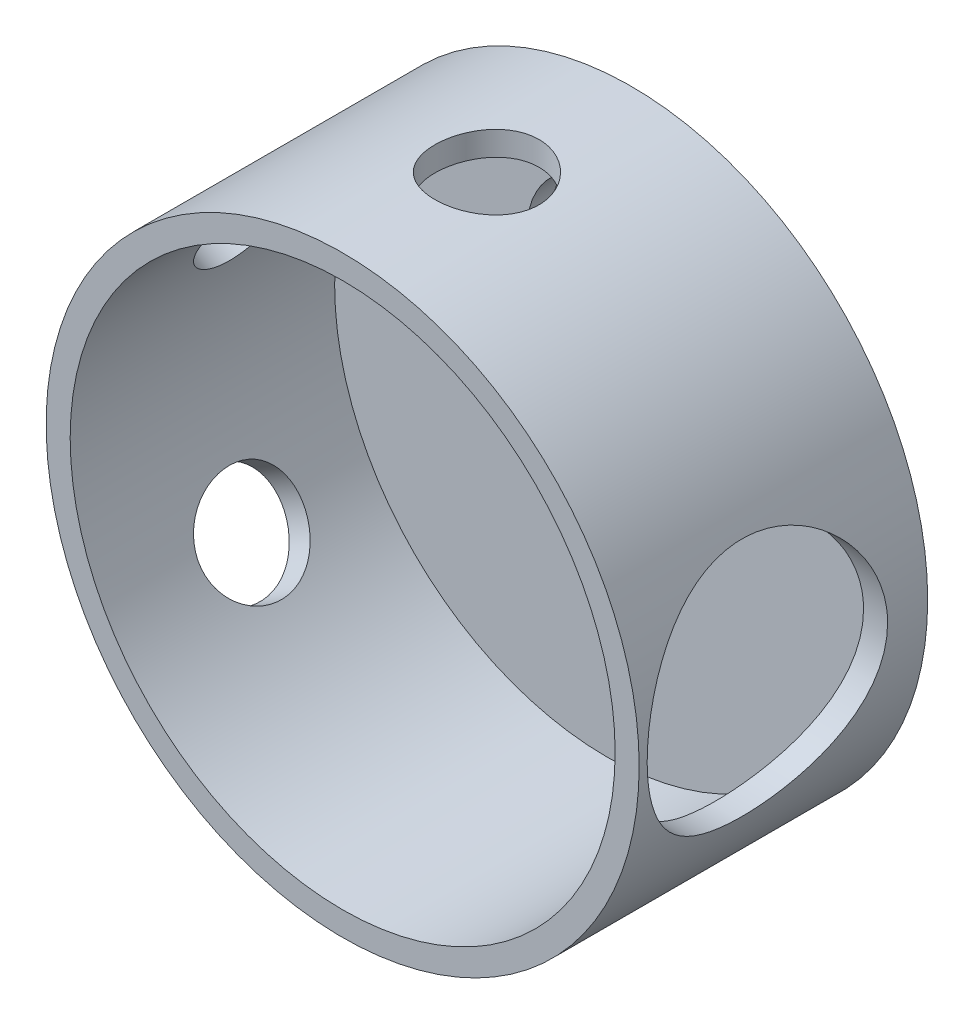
ISO-10303-21;
HEADER;
FILE_DESCRIPTION(('STEP AP214'),'2;1');
FILE_NAME('part.step','',(''),(''),'','','');
FILE_SCHEMA(('AUTOMOTIVE_DESIGN { 1 0 10303 214 1 1 1 1 }'));
ENDSEC;
DATA;
#1=APPLICATION_CONTEXT('core data for automotive mechanical design processes');
#2=APPLICATION_PROTOCOL_DEFINITION('international standard','automotive_design',2000,#1);
#3=PRODUCT_CONTEXT('',#1,'mechanical');
#4=PRODUCT('Part','Part','',(#3));
#5=PRODUCT_RELATED_PRODUCT_CATEGORY('part','',(#4));
#6=PRODUCT_DEFINITION_FORMATION('','',#4);
#7=PRODUCT_DEFINITION_CONTEXT('part definition',#1,'design');
#8=PRODUCT_DEFINITION('design','',#6,#7);
#9=PRODUCT_DEFINITION_SHAPE('','',#8);
#10=(LENGTH_UNIT() NAMED_UNIT(*) SI_UNIT(.MILLI.,.METRE.));
#11=(NAMED_UNIT(*) PLANE_ANGLE_UNIT() SI_UNIT($,.RADIAN.));
#12=(NAMED_UNIT(*) SI_UNIT($,.STERADIAN.) SOLID_ANGLE_UNIT());
#13=UNCERTAINTY_MEASURE_WITH_UNIT(LENGTH_MEASURE(1.E-05),#10,'distance_accuracy_value','');
#14=(GEOMETRIC_REPRESENTATION_CONTEXT(3) GLOBAL_UNCERTAINTY_ASSIGNED_CONTEXT((#13)) GLOBAL_UNIT_ASSIGNED_CONTEXT((#10,
#11,#12)) REPRESENTATION_CONTEXT('',''));
#15=CARTESIAN_POINT('',(0.,0.,0.));
#16=DIRECTION('',(0.,0.,1.));
#17=DIRECTION('',(1.,0.,0.));
#18=AXIS2_PLACEMENT_3D('',#15,#16,#17);
#19=CARTESIAN_POINT('',(0.,0.,3.));
#20=DIRECTION('',(0.,0.,-1.));
#21=DIRECTION('',(-1.,0.,0.));
#22=AXIS2_PLACEMENT_3D('',#19,#20,#21);
#23=CYLINDRICAL_SURFACE('',#22,37.);
#24=CARTESIAN_POINT('',(-34.7946112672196,-12.5831246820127,18.));
#25=CARTESIAN_POINT('',(-34.7946115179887,-12.5831213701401,17.8189019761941));
#26=CARTESIAN_POINT('',(-34.7919978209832,-12.5903576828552,17.6378435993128));
#27=CARTESIAN_POINT('',(-34.7815379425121,-12.6192262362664,17.2769749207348));
#28=CARTESIAN_POINT('',(-34.7736907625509,-12.6408612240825,17.0971648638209));
#29=CARTESIAN_POINT('',(-34.7527426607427,-12.6983387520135,16.7400349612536));
#30=CARTESIAN_POINT('',(-34.7396385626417,-12.7341898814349,16.5627166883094));
#31=CARTESIAN_POINT('',(-34.7081496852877,-12.8197669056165,16.2118694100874));
#32=CARTESIAN_POINT('',(-34.6897629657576,-12.8694978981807,16.038341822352));
#33=CARTESIAN_POINT('',(-34.6477108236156,-12.9822859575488,15.6965781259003));
#34=CARTESIAN_POINT('',(-34.6240520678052,-13.0453261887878,15.5283356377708));
#35=CARTESIAN_POINT('',(-34.5714048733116,-13.1842132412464,15.1980130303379));
#36=CARTESIAN_POINT('',(-34.5424144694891,-13.2600647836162,15.0359352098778));
#37=CARTESIAN_POINT('',(-34.4790995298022,-13.4238368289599,14.7191874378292));
#38=CARTESIAN_POINT('',(-34.4447775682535,-13.5117515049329,14.564513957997));
#39=CARTESIAN_POINT('',(-34.3707584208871,-13.6989450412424,14.2634757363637));
#40=CARTESIAN_POINT('',(-34.3310592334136,-13.798228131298,14.1171141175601));
#41=CARTESIAN_POINT('',(-34.2458925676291,-14.0082761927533,13.832402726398));
#42=CARTESIAN_POINT('',(-34.2003742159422,-14.1191406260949,13.6941415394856));
#43=CARTESIAN_POINT('',(-34.1038701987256,-14.350671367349,13.4280381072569));
#44=CARTESIAN_POINT('',(-34.0528825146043,-14.4713412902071,13.3001997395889));
#45=CARTESIAN_POINT('',(-33.9455222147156,-14.7214138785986,13.0559116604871));
#46=CARTESIAN_POINT('',(-33.8891512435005,-14.8508138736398,12.9394584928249));
#47=CARTESIAN_POINT('',(-33.7710835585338,-15.1173797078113,12.7186635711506));
#48=CARTESIAN_POINT('',(-33.7093848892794,-15.2545483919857,12.6143262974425));
#49=CARTESIAN_POINT('',(-33.580417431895,-15.5364000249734,12.4179319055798));
#50=CARTESIAN_POINT('',(-33.5131159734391,-15.6811249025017,12.3259563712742));
#51=CARTESIAN_POINT('',(-33.3734695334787,-15.9761756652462,12.1557077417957));
#52=CARTESIAN_POINT('',(-33.3011226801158,-16.1265036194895,12.0774397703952));
#53=CARTESIAN_POINT('',(-33.1517056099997,-16.4314694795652,11.9352647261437));
#54=CARTESIAN_POINT('',(-33.0746374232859,-16.5861055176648,11.8713515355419));
#55=CARTESIAN_POINT('',(-32.916124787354,-16.8985074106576,11.7583152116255));
#56=CARTESIAN_POINT('',(-32.8346787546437,-17.056274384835,11.7091974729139));
#57=CARTESIAN_POINT('',(-32.5860873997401,-17.5291745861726,11.585583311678));
#58=CARTESIAN_POINT('',(-32.4129831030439,-17.8474067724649,11.5332018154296));
#59=CARTESIAN_POINT('',(-32.1452082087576,-18.3226382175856,11.5006552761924));
#60=CARTESIAN_POINT('',(-32.05455770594,-18.480760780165,11.497485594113));
#61=CARTESIAN_POINT('',(-31.871115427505,-18.7953483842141,11.5064343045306));
#62=CARTESIAN_POINT('',(-31.7783236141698,-18.9518133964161,11.5185529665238));
#63=CARTESIAN_POINT('',(-31.4998890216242,-19.4135168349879,11.577367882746));
#64=CARTESIAN_POINT('',(-31.3120309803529,-19.7148848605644,11.6462699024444));
#65=CARTESIAN_POINT('',(-30.9369044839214,-20.2984883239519,11.8416439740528));
#66=CARTESIAN_POINT('',(-30.7496360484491,-20.5807231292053,11.9681179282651));
#67=CARTESIAN_POINT('',(-30.3812698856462,-21.120743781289,12.2757028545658));
#68=CARTESIAN_POINT('',(-30.2002079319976,-21.3783995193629,12.457085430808));
#69=CARTESIAN_POINT('',(-29.8521366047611,-21.8618122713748,12.869137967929));
#70=CARTESIAN_POINT('',(-29.6851284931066,-22.0875664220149,13.0998123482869));
#71=CARTESIAN_POINT('',(-29.3697584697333,-22.5052619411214,13.6075932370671));
#72=CARTESIAN_POINT('',(-29.2216780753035,-22.6967068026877,13.8852834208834));
#73=CARTESIAN_POINT('',(-28.9533417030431,-23.0380400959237,14.4772559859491));
#74=CARTESIAN_POINT('',(-28.833086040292,-23.1879280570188,14.7915387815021));
#75=CARTESIAN_POINT('',(-28.6258873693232,-23.4432457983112,15.4484767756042));
#76=CARTESIAN_POINT('',(-28.5389894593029,-23.5486154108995,15.7911696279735));
#77=CARTESIAN_POINT('',(-28.4030854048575,-23.7123633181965,16.4948054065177));
#78=CARTESIAN_POINT('',(-28.3540755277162,-23.7707462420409,16.8557465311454));
#79=CARTESIAN_POINT('',(-28.2968757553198,-23.8388086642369,17.5805092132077));
#80=CARTESIAN_POINT('',(-28.2881534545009,-23.8491234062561,17.9442291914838));
#81=CARTESIAN_POINT('',(-28.3105305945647,-23.8225554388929,18.6686946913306));
#82=CARTESIAN_POINT('',(-28.3416283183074,-23.7856747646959,19.0294403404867));
#83=CARTESIAN_POINT('',(-28.441678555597,-23.665943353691,19.7350859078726));
#84=CARTESIAN_POINT('',(-28.5103599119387,-23.5834218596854,20.0800803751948));
#85=CARTESIAN_POINT('',(-28.6820252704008,-23.3743365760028,20.7474430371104));
#86=CARTESIAN_POINT('',(-28.7850115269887,-23.2477698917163,21.0698097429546));
#87=CARTESIAN_POINT('',(-29.0217094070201,-22.9516133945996,21.6863826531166));
#88=CARTESIAN_POINT('',(-29.1557237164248,-22.7815979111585,21.9802680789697));
#89=CARTESIAN_POINT('',(-29.4479390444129,-22.4025886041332,22.5282134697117));
#90=CARTESIAN_POINT('',(-29.6061419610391,-22.1935917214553,22.7822703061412));
#91=CARTESIAN_POINT('',(-29.9420460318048,-21.7383251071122,23.2463392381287));
#92=CARTESIAN_POINT('',(-30.1199525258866,-21.4916502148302,23.4558048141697));
#93=CARTESIAN_POINT('',(-30.4866909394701,-20.9681515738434,23.8209715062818));
#94=CARTESIAN_POINT('',(-30.6755224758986,-20.6913288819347,23.9766745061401));
#95=CARTESIAN_POINT('',(-30.9608705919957,-20.2596731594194,24.1659996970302));
#96=CARTESIAN_POINT('',(-31.0561581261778,-20.1133374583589,24.2216740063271));
#97=CARTESIAN_POINT('',(-31.2467842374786,-19.8158920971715,24.3181450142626));
#98=CARTESIAN_POINT('',(-31.3421227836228,-19.6647841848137,24.3589470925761));
#99=CARTESIAN_POINT('',(-31.5320429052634,-19.3587893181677,24.4253523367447));
#100=CARTESIAN_POINT('',(-31.6266243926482,-19.2039019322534,24.4509537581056));
#101=CARTESIAN_POINT('',(-31.8142517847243,-18.8914420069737,24.4867551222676));
#102=CARTESIAN_POINT('',(-31.9072977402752,-18.7338695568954,24.4969555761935));
#103=CARTESIAN_POINT('',(-32.0899003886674,-18.4193084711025,24.5018396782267));
#104=CARTESIAN_POINT('',(-32.1794871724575,-18.262340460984,24.4967300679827));
#105=CARTESIAN_POINT('',(-32.3558426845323,-17.9480337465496,24.4714817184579));
#106=CARTESIAN_POINT('',(-32.4426114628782,-17.7906950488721,24.4513432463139));
#107=CARTESIAN_POINT('',(-32.6127914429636,-17.4767765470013,24.3961888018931));
#108=CARTESIAN_POINT('',(-32.6962020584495,-17.3201968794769,24.3611702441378));
#109=CARTESIAN_POINT('',(-32.8591394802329,-17.0090500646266,24.2765393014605));
#110=CARTESIAN_POINT('',(-32.9386676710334,-16.8544822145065,24.2269321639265));
#111=CARTESIAN_POINT('',(-33.0933882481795,-16.5486252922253,24.1135513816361));
#112=CARTESIAN_POINT('',(-33.1685849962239,-16.397333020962,24.0497923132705));
#113=CARTESIAN_POINT('',(-33.3143758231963,-16.099065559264,23.9085732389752));
#114=CARTESIAN_POINT('',(-33.3849715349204,-15.9520888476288,23.8311181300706));
#115=CARTESIAN_POINT('',(-33.5213583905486,-15.6634613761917,23.6630144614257));
#116=CARTESIAN_POINT('',(-33.5871476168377,-15.521812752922,23.5723606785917));
#117=CARTESIAN_POINT('',(-33.7136738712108,-15.2450432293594,23.3785535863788));
#118=CARTESIAN_POINT('',(-33.774412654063,-15.1099200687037,23.2754046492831));
#119=CARTESIAN_POINT('',(-33.8914850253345,-14.8454850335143,23.0558667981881));
#120=CARTESIAN_POINT('',(-33.9477508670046,-14.7162718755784,22.9393228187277));
#121=CARTESIAN_POINT('',(-34.0548706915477,-14.4666591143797,22.6949585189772));
#122=CARTESIAN_POINT('',(-34.1057265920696,-14.3462563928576,22.5671422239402));
#123=CARTESIAN_POINT('',(-34.2020269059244,-14.1151352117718,22.3009909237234));
#124=CARTESIAN_POINT('',(-34.2474680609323,-14.0044225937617,22.1626496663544));
#125=CARTESIAN_POINT('',(-34.3328675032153,-13.7937351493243,21.8765102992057));
#126=CARTESIAN_POINT('',(-34.3728278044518,-13.6937563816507,21.7287156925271));
#127=CARTESIAN_POINT('',(-34.4475999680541,-13.5045656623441,21.4233559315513));
#128=CARTESIAN_POINT('',(-34.4823659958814,-13.4154507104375,21.2657194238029));
#129=CARTESIAN_POINT('',(-34.5463528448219,-13.2498071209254,20.9429654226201));
#130=CARTESIAN_POINT('',(-34.575575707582,-13.1732738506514,20.7778507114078));
#131=CARTESIAN_POINT('',(-34.6285018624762,-13.0335124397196,20.4413554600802));
#132=CARTESIAN_POINT('',(-34.6522088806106,-12.9702753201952,20.2699792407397));
#133=CARTESIAN_POINT('',(-34.6941519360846,-12.8576599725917,19.9221412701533));
#134=CARTESIAN_POINT('',(-34.71238912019,-12.8082788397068,19.745680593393));
#135=CARTESIAN_POINT('',(-34.7501666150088,-12.705517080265,19.3114187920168));
#136=CARTESIAN_POINT('',(-34.7668408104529,-12.6596927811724,19.0515364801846));
#137=CARTESIAN_POINT('',(-34.7890628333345,-12.5984993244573,18.5277413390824));
#138=CARTESIAN_POINT('',(-34.7946109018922,-12.5831295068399,18.263828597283));
#139=CARTESIAN_POINT('',(-34.7946112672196,-12.5831246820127,18.));
#140=B_SPLINE_CURVE_WITH_KNOTS('',3,(#24,#25,#26,#27,#28,#29,#30,#31,#32,#33,#34,#35,#36,#37,
#38,#39,#40,#41,#42,#43,#44,#45,#46,#47,#48,#49,#50,#51,#52,#53,#54,#55,#56,#57,#58,#59,#60,#61,
#62,#63,#64,#65,#66,#67,#68,#69,#70,#71,#72,#73,#74,#75,#76,#77,#78,#79,#80,#81,#82,#83,#84,#85,
#86,#87,#88,#89,#90,#91,#92,#93,#94,#95,#96,#97,#98,#99,#100,#101,#102,#103,#104,#105,#106,#107,
#108,#109,#110,#111,#112,#113,#114,#115,#116,#117,#118,#119,#120,#121,#122,#123,#124,#125,#126,
#127,#128,#129,#130,#131,#132,#133,#134,#135,#136,#137,#138,#139),.UNSPECIFIED.,.T.,.F.,(4,2,2,
2,2,2,2,2,2,2,2,2,2,2,2,2,2,2,2,2,2,2,2,2,2,2,2,2,2,2,2,2,2,2,2,2,2,2,2,2,2,2,2,2,2,2,2,2,2,2,2,
2,2,2,2,2,2,4),(0.,0.543062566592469,1.08622877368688,1.62972365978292,2.17341842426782,
2.71642951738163,3.25964115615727,3.80259131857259,4.34574415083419,4.89401984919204,
5.44249860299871,5.99081033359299,6.53932418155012,7.09129680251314,7.64347530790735,
8.19541803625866,8.74756176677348,9.83935004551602,10.3856957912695,10.9320511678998,
12.0117485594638,13.0914816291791,14.1766453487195,15.2619064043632,16.3617883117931,
17.4616826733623,18.5630588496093,19.6643265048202,20.7509983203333,21.8376232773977,
22.9165099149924,23.9954674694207,25.0854304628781,26.1754790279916,27.2782030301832,
28.3808883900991,28.9301974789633,29.4793076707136,30.0284808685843,30.5776358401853,
31.1194087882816,31.6611721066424,32.2030295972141,32.74469242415,33.2857999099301,
33.8267143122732,34.3678433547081,34.9087835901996,35.4567754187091,36.004572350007,
36.5526972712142,37.1006202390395,37.6531239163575,38.2054236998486,38.7573493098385,
39.3091591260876,40.1003248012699,40.8914733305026),.UNSPECIFIED.);
#141=CARTESIAN_POINT('',(-34.7946112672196,-12.5831246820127,18.));
#142=VERTEX_POINT('',#141);
#143=EDGE_CURVE('E107',#142,#142,#140,.T.);
#144=ORIENTED_EDGE('',*,*,#143,.F.);
#145=EDGE_LOOP('',(#144));
#146=FACE_BOUND('',#145,.T.);
#147=CARTESIAN_POINT('',(37.,0.,5.));
#148=CARTESIAN_POINT('',(36.9999980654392,-0.402844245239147,5.00000245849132));
#149=CARTESIAN_POINT('',(36.9934027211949,-0.805837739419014,5.01625061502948));
#150=CARTESIAN_POINT('',(36.9671862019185,-1.60896791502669,5.08109542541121));
#151=CARTESIAN_POINT('',(36.947556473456,-2.00910254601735,5.12971332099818));
#152=CARTESIAN_POINT('',(36.8957282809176,-2.80434709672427,5.25895939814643));
#153=CARTESIAN_POINT('',(36.8634996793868,-3.19944260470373,5.33966434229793));
#154=CARTESIAN_POINT('',(36.787333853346,-3.98071894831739,5.53225161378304));
#155=CARTESIAN_POINT('',(36.7433985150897,-4.36690120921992,5.64412891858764));
#156=CARTESIAN_POINT('',(36.6451148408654,-5.12657596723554,5.89758770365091));
#157=CARTESIAN_POINT('',(36.5908013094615,-5.50010610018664,6.03907004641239));
#158=CARTESIAN_POINT('',(36.4730241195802,-6.23349580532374,6.3507400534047));
#159=CARTESIAN_POINT('',(36.4095601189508,-6.59335486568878,6.52092879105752));
#160=CARTESIAN_POINT('',(36.2750694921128,-7.29709575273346,6.8885582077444));
#161=CARTESIAN_POINT('',(36.2040474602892,-7.64098710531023,7.08598235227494));
#162=CARTESIAN_POINT('',(36.0560702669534,-8.31129756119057,7.50684122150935));
#163=CARTESIAN_POINT('',(35.9791127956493,-8.63770977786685,7.73028608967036));
#164=CARTESIAN_POINT('',(35.8176526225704,-9.28503211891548,8.2119580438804));
#165=CARTESIAN_POINT('',(35.7329673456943,-9.60508603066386,8.47127498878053));
#166=CARTESIAN_POINT('',(35.5612338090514,-10.2225936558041,9.01510428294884));
#167=CARTESIAN_POINT('',(35.4741844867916,-10.5200369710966,9.29962809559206));
#168=CARTESIAN_POINT('',(35.2999420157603,-11.0906783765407,9.89227294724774));
#169=CARTESIAN_POINT('',(35.2127488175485,-11.3638645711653,10.2004054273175));
#170=CARTESIAN_POINT('',(35.0405800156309,-11.88414153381,10.8383126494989));
#171=CARTESIAN_POINT('',(34.9556034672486,-12.131243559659,11.1680779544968));
#172=CARTESIAN_POINT('',(34.7862714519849,-12.6088255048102,11.8634409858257));
#173=CARTESIAN_POINT('',(34.702129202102,-12.8379954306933,12.2299922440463));
#174=CARTESIAN_POINT('',(34.5414023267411,-13.2643673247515,12.9826260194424));
#175=CARTESIAN_POINT('',(34.4648145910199,-13.4615824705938,13.3687003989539));
#176=CARTESIAN_POINT('',(34.3216926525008,-13.822413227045,14.1579849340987));
#177=CARTESIAN_POINT('',(34.2551568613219,-13.9860341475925,14.5611923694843));
#178=CARTESIAN_POINT('',(34.1344637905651,-14.2780736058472,15.3819585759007));
#179=CARTESIAN_POINT('',(34.080305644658,-14.406494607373,15.7995163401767));
#180=CARTESIAN_POINT('',(33.9885523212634,-14.6216056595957,16.6261980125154));
#181=CARTESIAN_POINT('',(33.9503070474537,-14.7099508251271,17.0348190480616));
#182=CARTESIAN_POINT('',(33.8882673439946,-14.8523194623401,17.8590889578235));
#183=CARTESIAN_POINT('',(33.8644724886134,-14.9063439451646,18.2747376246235));
#184=CARTESIAN_POINT('',(33.8322198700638,-14.9794025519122,19.109510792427));
#185=CARTESIAN_POINT('',(33.8237553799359,-14.99845202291,19.5286336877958));
#186=CARTESIAN_POINT('',(33.8224632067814,-15.0013664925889,20.367015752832));
#187=CARTESIAN_POINT('',(33.8296347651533,-14.9852331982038,20.7862749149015));
#188=CARTESIAN_POINT('',(33.8582680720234,-14.9204154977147,21.5913454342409));
#189=CARTESIAN_POINT('',(33.8786645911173,-14.874156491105,21.9773930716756));
#190=CARTESIAN_POINT('',(33.932029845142,-14.7520096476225,22.7438652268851));
#191=CARTESIAN_POINT('',(33.9649978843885,-14.6761234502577,23.1242900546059));
#192=CARTESIAN_POINT('',(34.0424925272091,-14.4954594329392,23.8770492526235));
#193=CARTESIAN_POINT('',(34.0870206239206,-14.3906778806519,24.2493825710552));
#194=CARTESIAN_POINT('',(34.1863152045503,-14.1531763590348,24.9836226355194));
#195=CARTESIAN_POINT('',(34.2410820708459,-14.020455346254,25.3455289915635));
#196=CARTESIAN_POINT('',(34.3605230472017,-13.7251710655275,26.0641281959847));
#197=CARTESIAN_POINT('',(34.4253769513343,-13.5620527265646,26.4205628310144));
#198=CARTESIAN_POINT('',(34.5623680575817,-13.2090331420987,27.1186011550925));
#199=CARTESIAN_POINT('',(34.6345079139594,-13.0191221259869,27.4601993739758));
#200=CARTESIAN_POINT('',(34.7841680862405,-12.613814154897,28.1267367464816));
#201=CARTESIAN_POINT('',(34.8616890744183,-12.3984140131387,28.4516738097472));
#202=CARTESIAN_POINT('',(35.0201711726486,-11.943434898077,29.0832739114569));
#203=CARTESIAN_POINT('',(35.1011324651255,-11.7038546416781,29.3899359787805));
#204=CARTESIAN_POINT('',(35.2710888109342,-11.1817503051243,30.0072300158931));
#205=CARTESIAN_POINT('',(35.3602089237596,-10.8973245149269,30.3162216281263));
#206=CARTESIAN_POINT('',(35.5377521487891,-10.303598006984,30.9092556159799));
#207=CARTESIAN_POINT('',(35.6261755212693,-9.99430711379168,31.1933077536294));
#208=CARTESIAN_POINT('',(35.8000739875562,-9.35229158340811,31.7350397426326));
#209=CARTESIAN_POINT('',(35.885547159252,-9.0195520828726,31.9927026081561));
#210=CARTESIAN_POINT('',(36.0511900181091,-8.33284960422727,32.4796114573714));
#211=CARTESIAN_POINT('',(36.1313618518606,-7.97889532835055,32.7088689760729));
#212=CARTESIAN_POINT('',(36.2859160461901,-7.24404531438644,33.1418980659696));
#213=CARTESIAN_POINT('',(36.3601406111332,-6.86273876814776,33.3450300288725));
#214=CARTESIAN_POINT('',(36.4987644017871,-6.08252910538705,33.7182299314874));
#215=CARTESIAN_POINT('',(36.5631633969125,-5.68362557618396,33.8882970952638));
#216=CARTESIAN_POINT('',(36.6802327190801,-4.87122759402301,34.1936379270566));
#217=CARTESIAN_POINT('',(36.7329079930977,-4.45773938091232,34.3289262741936));
#218=CARTESIAN_POINT('',(36.8249814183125,-3.61919725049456,34.5633407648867));
#219=CARTESIAN_POINT('',(36.8643805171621,-3.19414416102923,34.6624694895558));
#220=CARTESIAN_POINT('',(36.9267472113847,-2.3619463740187,34.818550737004));
#221=CARTESIAN_POINT('',(36.950565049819,-1.95527501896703,34.8776929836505));
#222=CARTESIAN_POINT('',(36.9847601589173,-1.13789265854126,34.9624195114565));
#223=CARTESIAN_POINT('',(36.9951379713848,-0.727181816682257,34.9880051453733));
#224=CARTESIAN_POINT('',(37.0021613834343,0.0949728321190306,35.0053326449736));
#225=CARTESIAN_POINT('',(36.9988101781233,0.506416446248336,34.9970823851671));
#226=CARTESIAN_POINT('',(36.9784767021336,1.32689363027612,34.9468481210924));
#227=CARTESIAN_POINT('',(36.9614947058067,1.7359272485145,34.9048647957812));
#228=CARTESIAN_POINT('',(36.9154734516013,2.52950701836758,34.7903609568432));
#229=CARTESIAN_POINT('',(36.8870316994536,2.9143072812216,34.7193515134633));
#230=CARTESIAN_POINT('',(36.8189035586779,3.67622439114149,34.5477783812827));
#231=CARTESIAN_POINT('',(36.7792176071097,4.05334153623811,34.4472158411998));
#232=CARTESIAN_POINT('',(36.6895681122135,4.79750729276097,34.2174396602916));
#233=CARTESIAN_POINT('',(36.6396037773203,5.16455512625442,34.0882238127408));
#234=CARTESIAN_POINT('',(36.5305910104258,5.88635409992,33.8022298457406));
#235=CARTESIAN_POINT('',(36.4715422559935,6.24110480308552,33.6454507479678));
#236=CARTESIAN_POINT('',(36.3437991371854,6.94700256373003,33.3003089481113));
#237=CARTESIAN_POINT('',(36.2748640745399,7.29770366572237,33.1111235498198));
#238=CARTESIAN_POINT('',(36.1304645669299,7.98196859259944,32.7061500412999));
#239=CARTESIAN_POINT('',(36.055000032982,8.31553218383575,32.4903615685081));
#240=CARTESIAN_POINT('',(35.8993151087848,8.96383506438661,32.0335750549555));
#241=CARTESIAN_POINT('',(35.8190938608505,9.27857093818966,31.7925724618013));
#242=CARTESIAN_POINT('',(35.6557640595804,9.88766722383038,31.2867541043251));
#243=CARTESIAN_POINT('',(35.5726544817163,10.1820202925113,31.0219298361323));
#244=CARTESIAN_POINT('',(35.3998720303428,10.7679410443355,30.4513054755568));
#245=CARTESIAN_POINT('',(35.3101355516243,11.0579727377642,30.1439452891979));
#246=CARTESIAN_POINT('',(35.1320744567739,11.6112806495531,29.5056081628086));
#247=CARTESIAN_POINT('',(35.0437499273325,11.8745552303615,29.1746297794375));
#248=CARTESIAN_POINT('',(34.8709681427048,12.3727579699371,28.4908111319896));
#249=CARTESIAN_POINT('',(34.78651242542,12.6076749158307,28.1379623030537));
#250=CARTESIAN_POINT('',(34.6240264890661,13.0472873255,27.41269403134));
#251=CARTESIAN_POINT('',(34.5459937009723,13.2519948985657,27.0402825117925));
#252=CARTESIAN_POINT('',(34.3979031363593,13.6318124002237,26.2736548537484));
#253=CARTESIAN_POINT('',(34.3279462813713,13.8065587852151,25.8792387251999));
#254=CARTESIAN_POINT('',(34.1994136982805,14.1219380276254,25.0751697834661));
#255=CARTESIAN_POINT('',(34.1408381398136,14.2625703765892,24.665516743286));
#256=CARTESIAN_POINT('',(34.0372082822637,14.5081436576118,23.8342487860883));
#257=CARTESIAN_POINT('',(33.9921453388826,14.6131074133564,23.4126417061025));
#258=CARTESIAN_POINT('',(33.9172044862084,14.7862158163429,22.5606148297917));
#259=CARTESIAN_POINT('',(33.8873252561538,14.8543636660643,22.130195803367));
#260=CARTESIAN_POINT('',(33.8455243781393,14.9493458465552,21.2961615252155));
#261=CARTESIAN_POINT('',(33.8324422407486,14.9788532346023,20.8929068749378));
#262=CARTESIAN_POINT('',(33.8207657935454,15.0051999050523,20.0851306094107));
#263=CARTESIAN_POINT('',(33.8221707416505,15.0020408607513,19.6806090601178));
#264=CARTESIAN_POINT('',(33.8394179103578,14.9630958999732,18.8735075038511));
#265=CARTESIAN_POINT('',(33.8552583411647,14.9273140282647,18.4709272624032));
#266=CARTESIAN_POINT('',(33.900824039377,14.8235397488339,17.6707441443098));
#267=CARTESIAN_POINT('',(33.9305492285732,14.7555475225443,17.2731412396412));
#268=CARTESIAN_POINT('',(34.0013629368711,14.5916044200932,16.5023142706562));
#269=CARTESIAN_POINT('',(34.0419240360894,14.4969422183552,16.1287661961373));
#270=CARTESIAN_POINT('',(34.1336564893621,14.2796145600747,15.391270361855));
#271=CARTESIAN_POINT('',(34.1848274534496,14.1569501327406,15.0273222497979));
#272=CARTESIAN_POINT('',(34.2963303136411,13.8846445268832,14.3111127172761));
#273=CARTESIAN_POINT('',(34.3566625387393,13.7350023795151,13.9588517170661));
#274=CARTESIAN_POINT('',(34.4848876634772,13.409812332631,13.2677762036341));
#275=CARTESIAN_POINT('',(34.5527835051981,13.2342543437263,12.9289669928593));
#276=CARTESIAN_POINT('',(34.6984849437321,12.8475774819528,12.2474527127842));
#277=CARTESIAN_POINT('',(34.7766365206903,12.6349895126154,11.9056548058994));
#278=CARTESIAN_POINT('',(34.9373674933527,12.1835044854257,11.2407890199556));
#279=CARTESIAN_POINT('',(35.0199488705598,11.9445956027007,10.9177296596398));
#280=CARTESIAN_POINT('',(35.1873812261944,11.4419561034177,10.2921346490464));
#281=CARTESIAN_POINT('',(35.2722323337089,11.1782240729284,9.98960016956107));
#282=CARTESIAN_POINT('',(35.4420856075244,10.6273999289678,9.4066438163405));
#283=CARTESIAN_POINT('',(35.5270877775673,10.3403072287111,9.12622249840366));
#284=CARTESIAN_POINT('',(35.7008645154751,9.72407033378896,8.57082953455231));
#285=CARTESIAN_POINT('',(35.7895050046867,9.39339513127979,8.29751141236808));
#286=CARTESIAN_POINT('',(35.9621233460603,8.70919664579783,7.77977613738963));
#287=CARTESIAN_POINT('',(36.0461028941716,8.35568177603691,7.53534843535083));
#288=CARTESIAN_POINT('',(36.2071763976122,7.62754792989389,7.07693074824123));
#289=CARTESIAN_POINT('',(36.2842651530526,7.25291335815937,6.86296367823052));
#290=CARTESIAN_POINT('',(36.4293105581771,6.48520541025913,6.46750140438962));
#291=CARTESIAN_POINT('',(36.4972679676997,6.09213357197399,6.28600349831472));
#292=CARTESIAN_POINT('',(36.6209717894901,5.29746995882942,5.96013204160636));
#293=CARTESIAN_POINT('',(36.6769162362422,4.89615948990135,5.81514825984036));
#294=CARTESIAN_POINT('',(36.7765242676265,4.08114957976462,5.55954961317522));
#295=CARTESIAN_POINT('',(36.82018575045,3.66744803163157,5.44894063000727));
#296=CARTESIAN_POINT('',(36.8938244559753,2.83214430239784,5.26359958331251));
#297=CARTESIAN_POINT('',(36.9238401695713,2.41056788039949,5.18876657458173));
#298=CARTESIAN_POINT('',(36.9694523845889,1.56200254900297,5.07541858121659));
#299=CARTESIAN_POINT('',(36.9850596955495,1.13501794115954,5.03687636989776));
#300=CARTESIAN_POINT('',(36.9954928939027,0.589433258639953,5.01112091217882));
#301=CARTESIAN_POINT('',(36.9971822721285,0.471595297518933,5.0069515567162));
#302=CARTESIAN_POINT('',(36.99943610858,0.235842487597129,5.00139074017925));
#303=CARTESIAN_POINT('',(37.0000005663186,0.117927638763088,4.99999928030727));
#304=CARTESIAN_POINT('',(37.,0.,5.));
#305=B_SPLINE_CURVE_WITH_KNOTS('',3,(#147,#148,#149,#150,#151,#152,#153,#154,#155,#156,#157,
#158,#159,#160,#161,#162,#163,#164,#165,#166,#167,#168,#169,#170,#171,#172,#173,#174,#175,#176,
#177,#178,#179,#180,#181,#182,#183,#184,#185,#186,#187,#188,#189,#190,#191,#192,#193,#194,#195,
#196,#197,#198,#199,#200,#201,#202,#203,#204,#205,#206,#207,#208,#209,#210,#211,#212,#213,#214,
#215,#216,#217,#218,#219,#220,#221,#222,#223,#224,#225,#226,#227,#228,#229,#230,#231,#232,#233,
#234,#235,#236,#237,#238,#239,#240,#241,#242,#243,#244,#245,#246,#247,#248,#249,#250,#251,#252,
#253,#254,#255,#256,#257,#258,#259,#260,#261,#262,#263,#264,#265,#266,#267,#268,#269,#270,#271,
#272,#273,#274,#275,#276,#277,#278,#279,#280,#281,#282,#283,#284,#285,#286,#287,#288,#289,#290,
#291,#292,#293,#294,#295,#296,#297,#298,#299,#300,#301,#302,#303,#304),.UNSPECIFIED.,.T.,.F.,(4,
2,2,2,2,2,2,2,2,2,2,2,2,2,2,2,2,2,2,2,2,2,2,2,2,2,2,2,2,2,2,2,2,2,2,2,2,2,2,2,2,2,2,2,2,2,2,2,2,
2,2,2,2,2,2,2,2,2,2,2,2,2,2,2,2,2,2,2,2,2,2,2,2,2,2,2,2,2,4),(0.,1.2084119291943,
2.41761762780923,3.62973371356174,4.84165461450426,6.04958034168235,7.25755124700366,
8.46479199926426,9.67250494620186,10.9327255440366,12.1935222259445,13.4549338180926,
14.7157987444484,16.0353820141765,17.3544197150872,18.6732487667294,19.9919854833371,
21.2497412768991,22.5074600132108,23.7646267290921,25.0217324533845,26.1883956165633,
27.3549942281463,28.5217435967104,29.6885365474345,30.879204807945,32.0703084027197,
33.2615610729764,34.4528769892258,35.7393742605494,37.0253656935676,38.3121797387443,
39.5984695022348,40.9118921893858,42.2253456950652,43.5382439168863,44.8510484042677,
46.0843890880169,47.3176800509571,48.5506840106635,49.7836631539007,50.9592975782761,
52.1348863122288,53.3105656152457,54.4862866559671,55.6981474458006,56.9100247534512,
58.1221212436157,59.3346521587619,60.6292234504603,61.9238739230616,63.2190346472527,
64.513674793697,65.8230559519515,67.1324566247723,68.4410178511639,69.7494652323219,
70.9615466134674,72.1735659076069,73.385434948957,74.5972971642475,75.7584601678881,
76.9195805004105,78.0807425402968,79.2423578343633,80.4711288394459,81.7004541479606,
82.9298495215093,84.1592757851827,85.4719151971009,86.7840738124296,88.0972143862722,
89.4102456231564,90.6996080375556,91.9891909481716,93.2751133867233,94.5600703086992,
94.9138177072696,95.2675652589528),.UNSPECIFIED.);
#306=CARTESIAN_POINT('',(37.,0.,5.));
#307=VERTEX_POINT('',#306);
#308=EDGE_CURVE('E61',#307,#307,#305,.T.);
#309=ORIENTED_EDGE('',*,*,#308,.T.);
#310=EDGE_LOOP('',(#309));
#311=FACE_BOUND('',#310,.T.);
#312=CARTESIAN_POINT('',(0.,0.,0.));
#313=DIRECTION('',(0.,0.,1.));
#314=DIRECTION('',(1.,0.,0.));
#315=AXIS2_PLACEMENT_3D('',#312,#313,#314);
#316=CIRCLE('',#315,37.);
#317=CARTESIAN_POINT('',(37.,0.,0.));
#318=VERTEX_POINT('',#317);
#319=EDGE_CURVE('E46',#318,#318,#316,.T.);
#320=ORIENTED_EDGE('',*,*,#319,.T.);
#321=EDGE_LOOP('',(#320));
#322=FACE_BOUND('',#321,.T.);
#323=CARTESIAN_POINT('',(0.,0.,36.));
#324=DIRECTION('',(0.,0.,1.));
#325=DIRECTION('',(1.,0.,0.));
#326=AXIS2_PLACEMENT_3D('',#323,#324,#325);
#327=CIRCLE('',#326,37.);
#328=CARTESIAN_POINT('',(37.,0.,36.));
#329=VERTEX_POINT('',#328);
#330=EDGE_CURVE('E51',#329,#329,#327,.T.);
#331=ORIENTED_EDGE('',*,*,#330,.F.);
#332=EDGE_LOOP('',(#331));
#333=FACE_BOUND('',#332,.T.);
#334=CARTESIAN_POINT('',(0.,37.,11.5));
#335=CARTESIAN_POINT('',(-0.181122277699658,37.0000013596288,11.4999970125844));
#336=CARTESIAN_POINT('',(-0.362204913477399,36.9986676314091,11.5075726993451));
#337=CARTESIAN_POINT('',(-0.723122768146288,36.9933729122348,11.5378117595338));
#338=CARTESIAN_POINT('',(-0.902957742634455,36.989411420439,11.5604780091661));
#339=CARTESIAN_POINT('',(-1.26013801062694,36.9789670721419,11.6207460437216));
#340=CARTESIAN_POINT('',(-1.43748173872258,36.9724826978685,11.6583568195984));
#341=CARTESIAN_POINT('',(-1.7883804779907,36.9571717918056,11.7482396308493));
#342=CARTESIAN_POINT('',(-1.96193407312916,36.9483444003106,11.8005170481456));
#343=CARTESIAN_POINT('',(-2.30375310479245,36.9286067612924,11.9192584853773));
#344=CARTESIAN_POINT('',(-2.4720248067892,36.9176990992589,11.9857049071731));
#345=CARTESIAN_POINT('',(-2.80240336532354,36.8940913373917,12.1323589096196));
#346=CARTESIAN_POINT('',(-2.96450792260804,36.8813905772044,12.2125715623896));
#347=CARTESIAN_POINT('',(-3.28130445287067,36.8545560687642,12.3861202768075));
#348=CARTESIAN_POINT('',(-3.43599997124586,36.8404230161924,12.4794499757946));
#349=CARTESIAN_POINT('',(-3.73707629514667,36.8111009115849,12.6786416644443));
#350=CARTESIAN_POINT('',(-3.8834539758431,36.7959114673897,12.7845083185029));
#351=CARTESIAN_POINT('',(-4.16814387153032,36.7647558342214,13.0090341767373));
#352=CARTESIAN_POINT('',(-4.30637054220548,36.7487838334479,13.1278010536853));
#353=CARTESIAN_POINT('',(-4.57240459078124,36.716632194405,13.3765498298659));
#354=CARTESIAN_POINT('',(-4.70020809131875,36.7004524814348,13.5065358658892));
#355=CARTESIAN_POINT('',(-4.94442790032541,36.6683487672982,13.7767562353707));
#356=CARTESIAN_POINT('',(-5.06084761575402,36.6524246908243,13.9169874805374));
#357=CARTESIAN_POINT('',(-5.28157814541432,36.6212692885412,14.206831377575));
#358=CARTESIAN_POINT('',(-5.38588447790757,36.6060382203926,14.3564474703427));
#359=CARTESIAN_POINT('',(-5.58224347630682,36.5766111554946,14.6650017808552));
#360=CARTESIAN_POINT('',(-5.67421161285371,36.5624225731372,14.823994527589));
#361=CARTESIAN_POINT('',(-5.84444476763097,36.5355976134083,15.1493517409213));
#362=CARTESIAN_POINT('',(-5.92270466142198,36.5229618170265,15.3157189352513));
#363=CARTESIAN_POINT('',(-6.06486317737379,36.4996252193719,15.6545477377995));
#364=CARTESIAN_POINT('',(-6.12876795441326,36.4889235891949,15.8270066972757));
#365=CARTESIAN_POINT('',(-6.24178724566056,36.4697589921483,16.1768246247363));
#366=CARTESIAN_POINT('',(-6.29089636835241,36.4612968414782,16.3541853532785));
#367=CARTESIAN_POINT('',(-6.41448680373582,36.4398374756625,16.8880631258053));
#368=CARTESIAN_POINT('',(-6.46684996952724,36.4304920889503,17.2502471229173));
#369=CARTESIAN_POINT('',(-6.49936036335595,36.4246925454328,17.7957481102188));
#370=CARTESIAN_POINT('',(-6.5025165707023,36.4241305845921,17.9780281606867));
#371=CARTESIAN_POINT('',(-6.49353821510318,36.4257325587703,18.3422217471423));
#372=CARTESIAN_POINT('',(-6.48140338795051,36.4278965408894,18.5241352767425));
#373=CARTESIAN_POINT('',(-6.42255676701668,36.4383406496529,19.063058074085));
#374=CARTESIAN_POINT('',(-6.35366610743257,36.4505272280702,19.4178213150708));
#375=CARTESIAN_POINT('',(-6.15836899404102,36.4840254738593,20.1104895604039));
#376=CARTESIAN_POINT('',(-6.03196036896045,36.5053374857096,20.448393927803));
#377=CARTESIAN_POINT('',(-5.72451355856,36.5548111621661,21.1000584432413));
#378=CARTESIAN_POINT('',(-5.54318899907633,36.5830085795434,21.4136809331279));
#379=CARTESIAN_POINT('',(-5.13126182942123,36.6430530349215,22.0062988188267));
#380=CARTESIAN_POINT('',(-4.90065481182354,36.6749003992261,22.2852911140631));
#381=CARTESIAN_POINT('',(-4.39292355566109,36.7391950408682,22.8047817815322));
#382=CARTESIAN_POINT('',(-4.11520144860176,36.771644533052,23.0446959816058));
#383=CARTESIAN_POINT('',(-3.52313663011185,36.8330821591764,23.4746096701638));
#384=CARTESIAN_POINT('',(-3.2087936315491,36.8620702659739,23.6646087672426));
#385=CARTESIAN_POINT('',(-2.55183561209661,36.9133670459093,23.9893669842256));
#386=CARTESIAN_POINT('',(-2.2091926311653,36.9356690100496,24.1240706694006));
#387=CARTESIAN_POINT('',(-1.50566578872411,36.9710277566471,24.3338515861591));
#388=CARTESIAN_POINT('',(-1.14478362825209,36.9840853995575,24.4089343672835));
#389=CARTESIAN_POINT('',(-0.420054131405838,36.9993675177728,24.4965414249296));
#390=CARTESIAN_POINT('',(-0.05630649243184,37.0017307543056,24.5098670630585));
#391=CARTESIAN_POINT('',(0.668221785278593,36.995739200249,24.4757234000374));
#392=CARTESIAN_POINT('',(1.02900255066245,36.9873848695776,24.4282567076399));
#393=CARTESIAN_POINT('',(1.73485262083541,36.9609829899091,24.2745426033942));
#394=CARTESIAN_POINT('',(2.08001180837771,36.9430014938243,24.1686955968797));
#395=CARTESIAN_POINT('',(2.74768606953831,36.8993531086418,23.9016537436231));
#396=CARTESIAN_POINT('',(3.07019975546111,36.8736857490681,23.7404555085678));
#397=CARTESIAN_POINT('',(3.68688229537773,36.817167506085,23.365482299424));
#398=CARTESIAN_POINT('',(3.98074505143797,36.7862686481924,23.1512113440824));
#399=CARTESIAN_POINT('',(4.52863267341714,36.7228497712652,22.6768347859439));
#400=CARTESIAN_POINT('',(4.78265429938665,36.6903296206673,22.4167254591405));
#401=CARTESIAN_POINT('',(5.24663349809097,36.6268811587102,21.8545141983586));
#402=CARTESIAN_POINT('',(5.45604713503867,36.5959756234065,21.5519611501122));
#403=CARTESIAN_POINT('',(5.82112283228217,36.5396889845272,20.9152977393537));
#404=CARTESIAN_POINT('',(5.97678672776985,36.5143076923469,20.5811884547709));
#405=CARTESIAN_POINT('',(6.16608541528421,36.4826444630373,20.0647027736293));
#406=CARTESIAN_POINT('',(6.2217611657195,36.4731689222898,19.890298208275));
#407=CARTESIAN_POINT('',(6.31823047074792,36.4565822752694,19.5373263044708));
#408=CARTESIAN_POINT('',(6.359029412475,36.4494703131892,19.358760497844));
#409=CARTESIAN_POINT('',(6.42542299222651,36.4378247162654,18.998733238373));
#410=CARTESIAN_POINT('',(6.45101595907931,36.4332913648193,18.8172714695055));
#411=CARTESIAN_POINT('',(6.48679470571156,36.426938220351,18.4527896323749));
#412=CARTESIAN_POINT('',(6.49698100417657,36.4251183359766,18.2697696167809));
#413=CARTESIAN_POINT('',(6.50183005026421,36.424253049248,17.9060643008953));
#414=CARTESIAN_POINT('',(6.4967065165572,36.425169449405,17.7253818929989));
#415=CARTESIAN_POINT('',(6.47143864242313,36.4296671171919,17.3651066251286));
#416=CARTESIAN_POINT('',(6.4512945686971,36.433248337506,17.1855137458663));
#417=CARTESIAN_POINT('',(6.39613762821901,36.44297196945,16.8286650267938));
#418=CARTESIAN_POINT('',(6.36112214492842,36.4491148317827,16.6514096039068));
#419=CARTESIAN_POINT('',(6.2765064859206,36.4637807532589,16.3005840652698));
#420=CARTESIAN_POINT('',(6.22691154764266,36.4723029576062,16.1270126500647));
#421=CARTESIAN_POINT('',(6.11356835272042,36.4914726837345,15.7848880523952));
#422=CARTESIAN_POINT('',(6.04983563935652,36.5021178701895,15.6163295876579));
#423=CARTESIAN_POINT('',(5.90868000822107,36.5252325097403,15.2852487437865));
#424=CARTESIAN_POINT('',(5.83126197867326,36.5377013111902,15.1227242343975));
#425=CARTESIAN_POINT('',(5.66324191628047,36.5641206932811,14.8046832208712));
#426=CARTESIAN_POINT('',(5.57263463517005,36.5780718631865,14.6491695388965));
#427=CARTESIAN_POINT('',(5.37892836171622,36.607058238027,14.3463127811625));
#428=CARTESIAN_POINT('',(5.2758337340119,36.6220930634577,14.1989668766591));
#429=CARTESIAN_POINT('',(5.05635585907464,36.6530450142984,13.9114283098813));
#430=CARTESIAN_POINT('',(4.93981156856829,36.6689713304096,13.7713595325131));
#431=CARTESIAN_POINT('',(4.69543959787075,36.7010629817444,13.5015599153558));
#432=CARTESIAN_POINT('',(4.56761594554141,36.7172282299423,13.3718254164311));
#433=CARTESIAN_POINT('',(4.30144296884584,36.7493614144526,13.1234497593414));
#434=CARTESIAN_POINT('',(4.16308742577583,36.7653292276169,13.0048152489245));
#435=CARTESIAN_POINT('',(3.87691254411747,36.7966065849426,12.7795888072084));
#436=CARTESIAN_POINT('',(3.72909671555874,36.8119163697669,12.6729924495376));
#437=CARTESIAN_POINT('',(3.4237190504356,36.8415779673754,12.4717217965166));
#438=CARTESIAN_POINT('',(3.26608753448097,36.8559209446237,12.3771518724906));
#439=CARTESIAN_POINT('',(2.94334215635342,36.8830984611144,12.2016843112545));
#440=CARTESIAN_POINT('',(2.7782310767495,36.8959335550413,12.1207816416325));
#441=CARTESIAN_POINT('',(2.44174256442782,36.9197278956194,11.9732587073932));
#442=CARTESIAN_POINT('',(2.27036943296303,36.9306884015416,11.9066288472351));
#443=CARTESIAN_POINT('',(1.92253858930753,36.9504290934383,11.7881071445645));
#444=CARTESIAN_POINT('',(1.74608194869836,36.9592097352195,11.7362122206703));
#445=CARTESIAN_POINT('',(1.31175775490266,36.9776251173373,11.6282839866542));
#446=CARTESIAN_POINT('',(1.05180747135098,36.9859754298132,11.5802367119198));
#447=CARTESIAN_POINT('',(0.527876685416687,36.9971618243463,11.5160972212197));
#448=CARTESIAN_POINT('',(0.263896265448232,36.9999980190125,11.5000043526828));
#449=CARTESIAN_POINT('',(0.,37.,11.5));
#450=B_SPLINE_CURVE_WITH_KNOTS('',3,(#334,#335,#336,#337,#338,#339,#340,#341,#342,#343,#344,
#345,#346,#347,#348,#349,#350,#351,#352,#353,#354,#355,#356,#357,#358,#359,#360,#361,#362,#363,
#364,#365,#366,#367,#368,#369,#370,#371,#372,#373,#374,#375,#376,#377,#378,#379,#380,#381,#382,
#383,#384,#385,#386,#387,#388,#389,#390,#391,#392,#393,#394,#395,#396,#397,#398,#399,#400,#401,
#402,#403,#404,#405,#406,#407,#408,#409,#410,#411,#412,#413,#414,#415,#416,#417,#418,#419,#420,
#421,#422,#423,#424,#425,#426,#427,#428,#429,#430,#431,#432,#433,#434,#435,#436,#437,#438,#439,
#440,#441,#442,#443,#444,#445,#446,#447,#448,#449),.UNSPECIFIED.,.T.,.F.,(4,2,2,2,2,2,2,2,2,2,2,
2,2,2,2,2,2,2,2,2,2,2,2,2,2,2,2,2,2,2,2,2,2,2,2,2,2,2,2,2,2,2,2,2,2,2,2,2,2,2,2,2,2,2,2,2,2,4),
(0.,0.543135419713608,1.0863743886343,1.62994067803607,2.17370669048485,2.71680122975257,
3.26009630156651,3.80312874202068,4.34636385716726,4.89454378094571,5.44292670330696,
5.99114499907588,6.53956548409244,7.09156978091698,7.64377999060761,8.1957529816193,
8.74792686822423,9.83981468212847,10.3862089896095,10.9326127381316,12.0118599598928,
13.0911479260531,14.1761639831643,15.2612771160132,16.3613606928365,17.4614528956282,
18.5626452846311,19.6637351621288,20.7504965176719,21.8372112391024,22.9165637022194,
23.9959822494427,25.0858963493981,26.175899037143,27.2785154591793,28.3810942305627,
28.93050954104,29.4797257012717,30.0290022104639,30.5782602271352,31.1198868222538,
31.6615038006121,32.2032161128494,32.7447340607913,33.285659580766,33.8263922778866,
34.3673407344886,34.9081006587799,35.456183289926,36.0040709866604,36.5522847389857,
37.100296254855,37.6527791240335,38.2050581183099,38.7569646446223,39.3087556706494,
40.1001234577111,40.8914750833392),.UNSPECIFIED.);
#451=CARTESIAN_POINT('',(0.,37.,11.5));
#452=VERTEX_POINT('',#451);
#453=EDGE_CURVE('E98',#452,#452,#450,.T.);
#454=ORIENTED_EDGE('',*,*,#453,.F.);
#455=EDGE_LOOP('',(#454));
#456=FACE_BOUND('',#455,.T.);
#457=CARTESIAN_POINT('',(-28.2946112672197,23.8414549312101,18.));
#458=CARTESIAN_POINT('',(-28.2946085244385,23.8414568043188,17.8189019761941));
#459=CARTESIAN_POINT('',(-28.2995685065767,23.8355751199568,17.6378435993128));
#460=CARTESIAN_POINT('',(-28.3193394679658,23.8120823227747,17.2769749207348));
#461=CARTESIAN_POINT('',(-28.3341523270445,23.7944689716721,17.0971648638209));
#462=CARTESIAN_POINT('',(-28.3734552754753,23.7475886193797,16.7400349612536));
#463=CARTESIAN_POINT('',(-28.3979512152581,23.7183145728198,16.5627166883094));
#464=CARTESIAN_POINT('',(-28.4563186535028,23.6482558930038,16.2118694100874));
#465=CARTESIAN_POINT('',(-28.4901935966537,23.6074670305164,16.038341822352));
#466=CARTESIAN_POINT('',(-28.566844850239,23.5146547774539,15.6965781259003));
#467=CARTESIAN_POINT('',(-28.6096099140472,23.4626455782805,15.5283356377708));
#468=CARTESIAN_POINT('',(-28.7035660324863,23.3476082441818,15.1980130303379));
#469=CARTESIAN_POINT('',(-28.7547601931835,23.2845760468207,15.0359352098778));
#470=CARTESIAN_POINT('',(-28.8649334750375,23.1478576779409,14.7191874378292));
#471=CARTESIAN_POINT('',(-28.9239088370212,23.0741766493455,14.564513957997));
#472=CARTESIAN_POINT('',(-29.0490136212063,22.916477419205,14.2634757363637));
#473=CARTESIAN_POINT('',(-29.1151457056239,22.8324553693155,14.1171141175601));
#474=CARTESIAN_POINT('',(-29.2544693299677,22.6536748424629,13.832402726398));
#475=CARTESIAN_POINT('',(-29.3277215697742,22.5588225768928,13.6941415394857));
#476=CARTESIAN_POINT('',(-29.479981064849,22.359482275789,13.4280381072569));
#477=CARTESIAN_POINT('',(-29.5589904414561,22.2549906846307,13.3001997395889));
#478=CARTESIAN_POINT('',(-29.7218795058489,22.0369776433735,13.0559116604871));
#479=CARTESIAN_POINT('',(-29.8057577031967,21.9234589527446,12.9394584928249));
#480=CARTESIAN_POINT('',(-29.9775766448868,21.6879264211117,12.7186635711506));
#481=CARTESIAN_POINT('',(-30.0655188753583,21.5659094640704,12.6143262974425));
#482=CARTESIAN_POINT('',(-30.2451258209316,21.3132945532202,12.4179319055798));
#483=CARTESIAN_POINT('',(-30.3368105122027,21.1826473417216,12.3259563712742));
#484=CARTESIAN_POINT('',(-30.5225087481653,20.9141845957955,12.1557077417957));
#485=CARTESIAN_POINT('',(-30.6165231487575,20.7763664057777,12.0774397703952));
#486=CARTESIAN_POINT('',(-30.805922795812,20.4944844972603,11.9352647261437));
#487=CARTESIAN_POINT('',(-30.9013074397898,20.3504234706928,11.8713515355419));
#488=CARTESIAN_POINT('',(-31.092599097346,20.0569465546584,11.7583152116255));
#489=CARTESIAN_POINT('',(-31.1885062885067,19.9075287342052,11.7091974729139));
#490=CARTESIAN_POINT('',(-31.473754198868,19.4557922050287,11.585583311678));
#491=CARTESIAN_POINT('',(-31.662799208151,19.1467633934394,11.5332018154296));
#492=CARTESIAN_POINT('',(-31.9404742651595,18.6772478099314,11.5006552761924));
#493=CARTESIAN_POINT('',(-32.032087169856,18.5196808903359,11.497485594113));
#494=CARTESIAN_POINT('',(-32.2128068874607,18.2035214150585,11.5064343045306));
#495=CARTESIAN_POINT('',(-32.3019136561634,18.044928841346,11.5185529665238));
#496=CARTESIAN_POINT('',(-32.5625432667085,17.5729456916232,11.577367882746));
#497=CARTESIAN_POINT('',(-32.7296066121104,17.2595718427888,11.6462699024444));
#498=CARTESIAN_POINT('',(-33.0474587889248,16.6429010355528,11.8416439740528));
#499=CARTESIAN_POINT('',(-33.1982470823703,16.33960441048,11.9681179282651));
#500=CARTESIAN_POINT('',(-33.4817356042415,15.7505796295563,12.2757028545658));
#501=CARTESIAN_POINT('',(-33.61434104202,15.4649475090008,12.457085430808));
#502=CARTESIAN_POINT('',(-33.8589531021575,14.9218025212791,12.869137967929));
#503=CARTESIAN_POINT('',(-33.9709578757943,14.6642921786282,13.0998123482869));
#504=CARTESIAN_POINT('',(-34.1750077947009,14.1823259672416,13.6075932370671));
#505=CARTESIAN_POINT('',(-34.2667637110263,13.9583621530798,13.8852834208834));
#506=CARTESIAN_POINT('',(-34.4281988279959,13.555309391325,14.4772559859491));
#507=CARTESIAN_POINT('',(-34.4978777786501,13.376220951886,14.7915387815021));
#508=CARTESIAN_POINT('',(-34.6153900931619,13.0691227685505,15.4484767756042));
#509=CARTESIAN_POINT('',(-34.6631938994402,12.941182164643,15.7911696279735));
#510=CARTESIAN_POINT('',(-34.7370517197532,12.7416118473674,16.4948054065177));
#511=CARTESIAN_POINT('',(-34.763107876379,12.6699765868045,16.8557465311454));
#512=CARTESIAN_POINT('',(-34.7934517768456,12.5864089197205,17.5805092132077));
#513=CARTESIAN_POINT('',(-34.7980234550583,12.5736978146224,17.9442291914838));
#514=CARTESIAN_POINT('',(-34.7862034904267,12.6063609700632,18.6686946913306));
#515=CARTESIAN_POINT('',(-34.7698127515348,12.6517327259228,19.0294403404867));
#516=CARTESIAN_POINT('',(-34.7161474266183,12.7982444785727,19.7350859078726));
#517=CARTESIAN_POINT('',(-34.6790223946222,12.8989850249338,20.0800803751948));
#518=CARTESIAN_POINT('',(-34.5837819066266,13.152194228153,20.7474430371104));
#519=CARTESIAN_POINT('',(-34.5256650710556,13.3046662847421,21.0698097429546));
#520=CARTESIAN_POINT('',(-34.3875349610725,13.6577309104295,21.6863826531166));
#521=CARTESIAN_POINT('',(-34.3073043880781,13.8587984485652,21.9802680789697));
#522=CARTESIAN_POINT('',(-34.1251803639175,14.3013689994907,22.5282134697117));
#523=CARTESIAN_POINT('',(-34.0232852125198,14.5428751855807,22.7822703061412));
#524=CARTESIAN_POINT('',(-33.7969647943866,15.06140995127,23.2463392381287));
#525=CARTESIAN_POINT('',(-33.6722913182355,15.338818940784,23.4558048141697));
#526=CARTESIAN_POINT('',(-33.4022974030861,15.9181730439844,23.8209715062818));
#527=CARTESIAN_POINT('',(-33.2569776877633,16.2201172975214,23.9766745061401));
#528=CARTESIAN_POINT('',(-33.0258269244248,16.6830638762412,24.1659996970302));
#529=CARTESIAN_POINT('',(-32.9467402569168,16.8387531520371,24.2216740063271));
#530=CARTESIAN_POINT('',(-32.7844580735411,17.152562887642,24.3181450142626));
#531=CARTESIAN_POINT('',(-32.7012640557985,17.3106824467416,24.3589470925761));
#532=CARTESIAN_POINT('',(-32.5312247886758,17.6281555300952,24.4253523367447));
#533=CARTESIAN_POINT('',(-32.4443791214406,17.7875091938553,24.4509537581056));
#534=CARTESIAN_POINT('',(-32.2675945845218,18.1062292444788,24.4867551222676));
#535=CARTESIAN_POINT('',(-32.1776558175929,18.2655956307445,24.4969555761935));
#536=CARTESIAN_POINT('',(-31.9965392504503,18.5810147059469,24.5018396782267));
#537=CARTESIAN_POINT('',(-31.9053943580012,18.7370831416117,24.4967300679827));
#538=CARTESIAN_POINT('',(-31.7213745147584,19.0469648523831,24.4714817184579));
#539=CARTESIAN_POINT('',(-31.6284995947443,19.2007781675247,24.4513432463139));
#540=CARTESIAN_POINT('',(-31.441728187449,19.5051176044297,24.3961888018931));
#541=CARTESIAN_POINT('',(-31.3478315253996,19.6556431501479,24.3611702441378));
#542=CARTESIAN_POINT('',(-31.1598391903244,19.9523245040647,24.2765393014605));
#543=CARTESIAN_POINT('',(-31.0657436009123,20.0984818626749,24.2269321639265));
#544=CARTESIAN_POINT('',(-30.8782240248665,20.3854022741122,24.1135513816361));
#545=CARTESIAN_POINT('',(-30.7847994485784,20.5261707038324,24.0497923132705));
#546=CARTESIAN_POINT('',(-30.5993876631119,20.8015629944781,23.9085732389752));
#547=CARTESIAN_POINT('',(-30.5073999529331,20.9361890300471,23.8311181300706));
#548=CARTESIAN_POINT('',(-30.3256346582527,21.1986172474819,23.6630144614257));
#549=CARTESIAN_POINT('',(-30.2358579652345,21.3264167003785,23.5723606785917));
#550=CARTESIAN_POINT('',(-30.0594316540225,21.5743764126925,23.3785535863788));
#551=CARTESIAN_POINT('',(-29.9727809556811,21.6945393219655,23.2754046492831));
#552=CARTESIAN_POINT('',(-29.8023096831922,21.9281444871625,23.0558667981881));
#553=CARTESIAN_POINT('',(-29.7185407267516,22.0414787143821,22.9393228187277));
#554=CARTESIAN_POINT('',(-29.5559296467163,22.2590535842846,22.6949585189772));
#555=CARTESIAN_POINT('',(-29.4770857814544,22.36329744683,22.5671422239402));
#556=CARTESIAN_POINT('',(-29.3250791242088,22.5622565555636,22.3009909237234));
#557=CARTESIAN_POINT('',(-29.2519197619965,22.6569660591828,22.1626496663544));
#558=CARTESIAN_POINT('',(-29.1121588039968,22.8362678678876,21.8765102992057));
#559=CARTESIAN_POINT('',(-29.0455548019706,22.9208638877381,21.7287156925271));
#560=CARTESIAN_POINT('',(-28.919096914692,23.0802138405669,21.4233559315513));
#561=CARTESIAN_POINT('',(-28.8593041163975,23.1548795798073,21.2657194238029));
#562=CARTESIAN_POINT('',(-28.7478459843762,23.2931156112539,20.94296542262));
#563=CARTESIAN_POINT('',(-28.6961776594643,23.3566899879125,20.7778507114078));
#564=CARTESIAN_POINT('',(-28.6016038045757,23.4724060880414,20.4413554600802));
#565=CARTESIAN_POINT('',(-28.5586923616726,23.5245555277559,20.2699792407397));
#566=CARTESIAN_POINT('',(-28.482136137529,23.6171869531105,19.9221412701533));
#567=CARTESIAN_POINT('',(-28.4484894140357,23.6576713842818,19.745680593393));
#568=CARTESIAN_POINT('',(-28.3783838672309,23.7417685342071,19.3114187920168));
#569=CARTESIAN_POINT('',(-28.3470359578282,23.7791209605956,19.0515364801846));
#570=CARTESIAN_POINT('',(-28.3051518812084,23.8289625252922,18.5277413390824));
#571=CARTESIAN_POINT('',(-28.294615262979,23.8414522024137,18.263828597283));
#572=CARTESIAN_POINT('',(-28.2946112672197,23.8414549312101,18.));
#573=B_SPLINE_CURVE_WITH_KNOTS('',3,(#457,#458,#459,#460,#461,#462,#463,#464,#465,#466,#467,
#468,#469,#470,#471,#472,#473,#474,#475,#476,#477,#478,#479,#480,#481,#482,#483,#484,#485,#486,
#487,#488,#489,#490,#491,#492,#493,#494,#495,#496,#497,#498,#499,#500,#501,#502,#503,#504,#505,
#506,#507,#508,#509,#510,#511,#512,#513,#514,#515,#516,#517,#518,#519,#520,#521,#522,#523,#524,
#525,#526,#527,#528,#529,#530,#531,#532,#533,#534,#535,#536,#537,#538,#539,#540,#541,#542,#543,
#544,#545,#546,#547,#548,#549,#550,#551,#552,#553,#554,#555,#556,#557,#558,#559,#560,#561,#562,
#563,#564,#565,#566,#567,#568,#569,#570,#571,#572),.UNSPECIFIED.,.T.,.F.,(4,2,2,2,2,2,2,2,2,2,2,
2,2,2,2,2,2,2,2,2,2,2,2,2,2,2,2,2,2,2,2,2,2,2,2,2,2,2,2,2,2,2,2,2,2,2,2,2,2,2,2,2,2,2,2,2,2,4),
(0.,0.543062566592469,1.08622877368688,1.62972365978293,2.17341842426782,2.71642951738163,
3.25964115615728,3.80259131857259,4.34574415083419,4.89401984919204,5.44249860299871,
5.990810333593,6.53932418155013,7.09129680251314,7.64347530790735,8.19541803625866,
8.74756176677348,9.83935004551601,10.3856957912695,10.9320511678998,12.0117485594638,
13.0914816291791,14.1766453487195,15.2619064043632,16.3617883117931,17.4616826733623,
18.5630588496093,19.6643265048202,20.7509983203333,21.8376232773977,22.9165099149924,
23.9954674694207,25.0854304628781,26.1754790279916,27.2782030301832,28.3808883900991,
28.9301974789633,29.4793076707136,30.0284808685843,30.5776358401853,31.1194087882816,
31.6611721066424,32.2030295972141,32.74469242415,33.2857999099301,33.8267143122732,
34.3678433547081,34.9087835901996,35.4567754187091,36.004572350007,36.5526972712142,
37.1006202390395,37.6531239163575,38.2054236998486,38.7573493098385,39.3091591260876,
40.1003248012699,40.8914733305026),.UNSPECIFIED.);
#574=CARTESIAN_POINT('',(-28.2946112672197,23.8414549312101,18.));
#575=VERTEX_POINT('',#574);
#576=EDGE_CURVE('E101',#575,#575,#573,.T.);
#577=ORIENTED_EDGE('',*,*,#576,.F.);
#578=EDGE_LOOP('',(#577));
#579=FACE_BOUND('',#578,.T.);
#580=ADVANCED_FACE('F34',(#146,#311,#322,#333,#456,#579),#23,.T.);
#581=CARTESIAN_POINT('',(0.,0.,36.));
#582=DIRECTION('',(0.,0.,-1.));
#583=DIRECTION('',(-1.,0.,0.));
#584=AXIS2_PLACEMENT_3D('',#581,#582,#583);
#585=CYLINDRICAL_SURFACE('',#584,34.);
#586=CARTESIAN_POINT('',(-32.1517733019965,-11.0572814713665,18.));
#587=CARTESIAN_POINT('',(-32.1517734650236,-11.0572776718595,17.8191838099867));
#588=CARTESIAN_POINT('',(-32.1492748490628,-11.0645534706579,17.6384106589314));
#589=CARTESIAN_POINT('',(-32.1392723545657,-11.093575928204,17.2781145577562));
#590=CARTESIAN_POINT('',(-32.1317675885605,-11.1153251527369,17.0985918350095));
#591=CARTESIAN_POINT('',(-32.1117240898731,-11.1730973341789,16.7420480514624));
#592=CARTESIAN_POINT('',(-32.0991825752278,-11.2091281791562,16.5650284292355));
#593=CARTESIAN_POINT('',(-32.0690249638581,-11.2951190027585,16.2147771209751));
#594=CARTESIAN_POINT('',(-32.0514070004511,-11.3450841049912,16.041546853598));
#595=CARTESIAN_POINT('',(-32.0110798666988,-11.4583756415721,15.700383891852));
#596=CARTESIAN_POINT('',(-31.9883775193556,-11.5216841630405,15.5324444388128));
#597=CARTESIAN_POINT('',(-31.9378073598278,-11.661130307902,15.2027119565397));
#598=CARTESIAN_POINT('',(-31.9099376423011,-11.7372726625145,15.0409212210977));
#599=CARTESIAN_POINT('',(-31.8489991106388,-11.9016356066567,14.7247166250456));
#600=CARTESIAN_POINT('',(-31.8159326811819,-11.989850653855,14.570299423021));
#601=CARTESIAN_POINT('',(-31.7445299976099,-12.1776395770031,14.2697346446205));
#602=CARTESIAN_POINT('',(-31.7061917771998,-12.2772176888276,14.1235901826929));
#603=CARTESIAN_POINT('',(-31.623757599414,-12.4880304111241,13.8390083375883));
#604=CARTESIAN_POINT('',(-31.5796018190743,-12.599383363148,13.7006759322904));
#605=CARTESIAN_POINT('',(-31.4858397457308,-12.8318981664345,13.4344037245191));
#606=CARTESIAN_POINT('',(-31.4362314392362,-12.953063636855,13.3064677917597));
#607=CARTESIAN_POINT('',(-31.3316075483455,-13.2041225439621,13.0619519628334));
#608=CARTESIAN_POINT('',(-31.2765935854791,-13.3340133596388,12.9453686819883));
#609=CARTESIAN_POINT('',(-31.1611810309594,-13.6015449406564,12.7242787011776));
#610=CARTESIAN_POINT('',(-31.1007804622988,-13.7391885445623,12.6197764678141));
#611=CARTESIAN_POINT('',(-30.9742404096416,-14.0221476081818,12.4228904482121));
#612=CARTESIAN_POINT('',(-30.9080608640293,-14.1675133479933,12.3306046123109));
#613=CARTESIAN_POINT('',(-30.7705142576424,-14.463822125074,12.1597387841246));
#614=CARTESIAN_POINT('',(-30.699145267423,-14.6147672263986,12.081163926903));
#615=CARTESIAN_POINT('',(-30.5515103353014,-14.9209262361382,11.9383873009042));
#616=CARTESIAN_POINT('',(-30.475246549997,-15.0761382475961,11.8741792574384));
#617=CARTESIAN_POINT('',(-30.3181460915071,-15.3896361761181,11.7605731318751));
#618=CARTESIAN_POINT('',(-30.2373077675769,-15.5479231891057,11.7111804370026));
#619=CARTESIAN_POINT('',(-29.9905090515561,-16.0216799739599,11.5869437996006));
#620=CARTESIAN_POINT('',(-29.8183064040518,-16.3401301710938,11.5341457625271));
#621=CARTESIAN_POINT('',(-29.5512405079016,-16.8153985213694,11.5009253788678));
#622=CARTESIAN_POINT('',(-29.4607194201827,-16.9734842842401,11.4975227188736));
#623=CARTESIAN_POINT('',(-29.2773237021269,-17.2878976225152,11.50599037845));
#624=CARTESIAN_POINT('',(-29.1844490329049,-17.4442251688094,11.5178609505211));
#625=CARTESIAN_POINT('',(-28.9058366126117,-17.9047379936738,11.5758365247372));
#626=CARTESIAN_POINT('',(-28.7175950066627,-18.2049228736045,11.6440038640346));
#627=CARTESIAN_POINT('',(-28.3409759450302,-18.7858797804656,11.837603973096));
#628=CARTESIAN_POINT('',(-28.1525984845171,-19.0666510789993,11.963038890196));
#629=CARTESIAN_POINT('',(-27.7812428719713,-19.6038207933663,12.2683632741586));
#630=CARTESIAN_POINT('',(-27.5983026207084,-19.8600674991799,12.4485660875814));
#631=CARTESIAN_POINT('',(-27.2460198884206,-20.3406823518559,12.8580785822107));
#632=CARTESIAN_POINT('',(-27.0766788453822,-20.5650471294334,13.0873934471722));
#633=CARTESIAN_POINT('',(-26.7559517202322,-20.9806855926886,13.5929598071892));
#634=CARTESIAN_POINT('',(-26.6048948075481,-21.171374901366,13.8699011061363));
#635=CARTESIAN_POINT('',(-26.3307141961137,-21.5114237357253,14.4605658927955));
#636=CARTESIAN_POINT('',(-26.2075909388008,-21.6607826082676,14.7742899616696));
#637=CARTESIAN_POINT('',(-25.9950080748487,-21.9154569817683,15.4305253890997));
#638=CARTESIAN_POINT('',(-25.9056101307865,-22.0206918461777,15.773088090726));
#639=CARTESIAN_POINT('',(-25.7654314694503,-22.1845506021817,16.4767554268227));
#640=CARTESIAN_POINT('',(-25.7146461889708,-22.2431800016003,16.8378578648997));
#641=CARTESIAN_POINT('',(-25.654910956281,-22.3120508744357,17.5622971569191));
#642=CARTESIAN_POINT('',(-25.6453183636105,-22.323035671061,17.9255104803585));
#643=CARTESIAN_POINT('',(-25.6667239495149,-22.2984200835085,18.649135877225));
#644=CARTESIAN_POINT('',(-25.6977200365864,-22.2628220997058,19.0095480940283));
#645=CARTESIAN_POINT('',(-25.7981986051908,-22.1463026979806,19.7141472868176));
#646=CARTESIAN_POINT('',(-25.8673463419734,-22.0657754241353,20.0584475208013));
#647=CARTESIAN_POINT('',(-26.0403937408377,-21.8612836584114,20.7246837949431));
#648=CARTESIAN_POINT('',(-26.1442960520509,-21.7373158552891,21.0466181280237));
#649=CARTESIAN_POINT('',(-26.3833254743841,-21.4465813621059,21.6632260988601));
#650=CARTESIAN_POINT('',(-26.5188115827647,-21.2793199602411,21.9575271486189));
#651=CARTESIAN_POINT('',(-26.8141494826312,-20.9059294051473,22.5066310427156));
#652=CARTESIAN_POINT('',(-26.974003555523,-20.699796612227,22.76143018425));
#653=CARTESIAN_POINT('',(-27.313597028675,-20.249640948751,23.22790065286));
#654=CARTESIAN_POINT('',(-27.4935824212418,-20.0051302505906,23.4389217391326));
#655=CARTESIAN_POINT('',(-27.8642981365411,-19.4854390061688,23.8073183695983));
#656=CARTESIAN_POINT('',(-28.0550280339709,-19.2102596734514,23.9646960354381));
#657=CARTESIAN_POINT('',(-28.3428534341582,-18.7806405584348,24.1565094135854));
#658=CARTESIAN_POINT('',(-28.4388730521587,-18.6349606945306,24.2129965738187));
#659=CARTESIAN_POINT('',(-28.6308390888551,-18.3386509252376,24.3111068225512));
#660=CARTESIAN_POINT('',(-28.7267855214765,-18.1880228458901,24.3527353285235));
#661=CARTESIAN_POINT('',(-28.9177753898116,-17.8828046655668,24.4207949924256));
#662=CARTESIAN_POINT('',(-29.012818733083,-17.7282141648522,24.4472246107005));
#663=CARTESIAN_POINT('',(-29.2012079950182,-17.4161608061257,24.4846740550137));
#664=CARTESIAN_POINT('',(-29.2945539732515,-17.2586980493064,24.4956944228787));
#665=CARTESIAN_POINT('',(-29.4773521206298,-16.9445629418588,24.5021827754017));
#666=CARTESIAN_POINT('',(-29.5668426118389,-16.7879178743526,24.4978954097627));
#667=CARTESIAN_POINT('',(-29.7428460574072,-16.4740849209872,24.4743449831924));
#668=CARTESIAN_POINT('',(-29.8293590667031,-16.316897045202,24.4550821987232));
#669=CARTESIAN_POINT('',(-29.9988709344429,-16.0031106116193,24.4017284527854));
#670=CARTESIAN_POINT('',(-30.0818691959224,-15.846512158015,24.3676349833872));
#671=CARTESIAN_POINT('',(-30.2438350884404,-15.5351608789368,24.2848997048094));
#672=CARTESIAN_POINT('',(-30.3228041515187,-15.3804074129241,24.2362631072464));
#673=CARTESIAN_POINT('',(-30.4762329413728,-15.0741010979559,24.1248955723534));
#674=CARTESIAN_POINT('',(-30.5506995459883,-14.9225436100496,24.0621868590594));
#675=CARTESIAN_POINT('',(-30.6949233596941,-14.6235843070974,23.9231219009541));
#676=CARTESIAN_POINT('',(-30.7646822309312,-14.4761810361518,23.8467705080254));
#677=CARTESIAN_POINT('',(-30.8993132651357,-14.1865414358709,23.6809217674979));
#678=CARTESIAN_POINT('',(-30.9641834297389,-14.0443072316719,23.5914190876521));
#679=CARTESIAN_POINT('',(-31.0888177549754,-13.7662131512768,23.3999527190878));
#680=CARTESIAN_POINT('',(-31.1485836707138,-13.6303510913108,23.2979933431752));
#681=CARTESIAN_POINT('',(-31.2637985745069,-13.3639917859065,23.0806429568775));
#682=CARTESIAN_POINT('',(-31.3191680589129,-13.2336075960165,22.9650712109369));
#683=CARTESIAN_POINT('',(-31.4244821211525,-12.9815476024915,22.7226170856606));
#684=CARTESIAN_POINT('',(-31.4744286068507,-12.8598687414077,22.5957387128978));
#685=CARTESIAN_POINT('',(-31.5689305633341,-12.6261051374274,22.3314176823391));
#686=CARTESIAN_POINT('',(-31.6134827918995,-12.5140261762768,22.1939687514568));
#687=CARTESIAN_POINT('',(-31.6971602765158,-12.3005355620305,21.9095532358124));
#688=CARTESIAN_POINT('',(-31.7362875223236,-12.1991200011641,21.7625901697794));
#689=CARTESIAN_POINT('',(-31.8095386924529,-12.0068290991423,21.45856383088));
#690=CARTESIAN_POINT('',(-31.8436081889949,-11.9160703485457,21.3014136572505));
#691=CARTESIAN_POINT('',(-31.9063061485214,-11.7471589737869,20.9795169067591));
#692=CARTESIAN_POINT('',(-31.9349366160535,-11.6690017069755,20.8147731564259));
#693=CARTESIAN_POINT('',(-31.9868125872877,-11.5260404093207,20.4788903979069));
#694=CARTESIAN_POINT('',(-32.0100615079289,-11.4612279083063,20.3077555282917));
#695=CARTESIAN_POINT('',(-32.0512462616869,-11.345544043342,19.960275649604));
#696=CARTESIAN_POINT('',(-32.0691831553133,-11.2946698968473,19.7839316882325));
#697=CARTESIAN_POINT('',(-32.1069639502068,-11.1869374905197,19.3437799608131));
#698=CARTESIAN_POINT('',(-32.1237792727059,-11.1384001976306,19.0776233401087));
#699=CARTESIAN_POINT('',(-32.1461836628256,-11.0735755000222,18.5409456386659));
#700=CARTESIAN_POINT('',(-32.1517730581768,-11.0572871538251,18.2704246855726));
#701=CARTESIAN_POINT('',(-32.1517733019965,-11.0572814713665,18.));
#702=B_SPLINE_CURVE_WITH_KNOTS('',3,(#586,#587,#588,#589,#590,#591,#592,#593,#594,#595,#596,
#597,#598,#599,#600,#601,#602,#603,#604,#605,#606,#607,#608,#609,#610,#611,#612,#613,#614,#615,
#616,#617,#618,#619,#620,#621,#622,#623,#624,#625,#626,#627,#628,#629,#630,#631,#632,#633,#634,
#635,#636,#637,#638,#639,#640,#641,#642,#643,#644,#645,#646,#647,#648,#649,#650,#651,#652,#653,
#654,#655,#656,#657,#658,#659,#660,#661,#662,#663,#664,#665,#666,#667,#668,#669,#670,#671,#672,
#673,#674,#675,#676,#677,#678,#679,#680,#681,#682,#683,#684,#685,#686,#687,#688,#689,#690,#691,
#692,#693,#694,#695,#696,#697,#698,#699,#700,#701),.UNSPECIFIED.,.T.,.F.,(4,2,2,2,2,2,2,2,2,2,2,
2,2,2,2,2,2,2,2,2,2,2,2,2,2,2,2,2,2,2,2,2,2,2,2,2,2,2,2,2,2,2,2,2,2,2,2,2,2,2,2,2,2,2,2,2,2,4),
(0.,0.542211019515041,1.0845181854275,1.62712529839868,2.16993219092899,2.71201498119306,
3.25429805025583,3.79633299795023,4.33857066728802,4.88689750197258,5.43542750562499,
5.98379346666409,6.53236152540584,7.08509126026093,7.63802756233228,8.19072189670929,
8.74361696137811,9.83485799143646,10.3809251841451,10.9270014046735,12.0039419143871,
13.0809228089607,14.1641853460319,15.2475622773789,16.3482054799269,17.4488660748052,
18.5515294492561,19.6540624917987,20.7393311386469,21.8245438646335,22.9003828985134,
23.9763039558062,25.0651084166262,26.1540148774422,27.2580904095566,28.3621222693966,
28.9117535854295,29.4611843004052,30.0106706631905,30.5601377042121,31.1008626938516,
31.6415777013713,32.1823841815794,32.7229970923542,33.262762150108,33.802335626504,
34.3421284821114,34.881734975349,35.4295503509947,35.9771723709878,36.5251219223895,
37.072869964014,37.6261410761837,38.1792078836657,38.7319225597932,39.2845268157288,
40.0954692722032,40.9063880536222),.UNSPECIFIED.);
#703=CARTESIAN_POINT('',(-32.1517733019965,-11.0572814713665,18.));
#704=VERTEX_POINT('',#703);
#705=EDGE_CURVE('E134',#704,#704,#702,.T.);
#706=ORIENTED_EDGE('',*,*,#705,.T.);
#707=EDGE_LOOP('',(#706));
#708=FACE_BOUND('',#707,.T.);
#709=CARTESIAN_POINT('',(0.,0.,3.));
#710=DIRECTION('',(0.,0.,1.));
#711=DIRECTION('',(1.,0.,0.));
#712=AXIS2_PLACEMENT_3D('',#709,#710,#711);
#713=CIRCLE('',#712,34.);
#714=CARTESIAN_POINT('',(34.,0.,3.));
#715=VERTEX_POINT('',#714);
#716=EDGE_CURVE('E11',#715,#715,#713,.F.);
#717=ORIENTED_EDGE('',*,*,#716,.T.);
#718=EDGE_LOOP('',(#717));
#719=FACE_BOUND('',#718,.T.);
#720=CARTESIAN_POINT('',(0.,0.,36.));
#721=DIRECTION('',(0.,0.,1.));
#722=DIRECTION('',(1.,0.,0.));
#723=AXIS2_PLACEMENT_3D('',#720,#721,#722);
#724=CIRCLE('',#723,34.);
#725=CARTESIAN_POINT('',(34.,0.,36.));
#726=VERTEX_POINT('',#725);
#727=EDGE_CURVE('E83',#726,#726,#724,.T.);
#728=ORIENTED_EDGE('',*,*,#727,.T.);
#729=EDGE_LOOP('',(#728));
#730=FACE_BOUND('',#729,.T.);
#731=CARTESIAN_POINT('',(34.,0.,5.));
#732=CARTESIAN_POINT('',(33.9999975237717,-0.399823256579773,5.00000297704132));
#733=CARTESIAN_POINT('',(33.9929287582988,-0.799752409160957,5.01600682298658));
#734=CARTESIAN_POINT('',(33.9648290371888,-1.59673576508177,5.07986562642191));
#735=CARTESIAN_POINT('',(33.9437900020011,-1.99378817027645,5.12773901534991));
#736=CARTESIAN_POINT('',(33.8882424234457,-2.78275636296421,5.25495822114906));
#737=CARTESIAN_POINT('',(33.8537047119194,-3.17465911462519,5.33437219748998));
#738=CARTESIAN_POINT('',(33.7720687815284,-3.94957834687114,5.52381522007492));
#739=CARTESIAN_POINT('',(33.7249723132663,-4.33259605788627,5.63383999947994));
#740=CARTESIAN_POINT('',(33.6196015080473,-5.08591648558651,5.88297858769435));
#741=CARTESIAN_POINT('',(33.5613674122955,-5.45625948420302,6.0219878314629));
#742=CARTESIAN_POINT('',(33.4350373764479,-6.18340311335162,6.32808893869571));
#743=CARTESIAN_POINT('',(33.3669411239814,-6.54020331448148,6.4951816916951));
#744=CARTESIAN_POINT('',(33.2225403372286,-7.23807519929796,6.85600893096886));
#745=CARTESIAN_POINT('',(33.1462400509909,-7.57915489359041,7.04972964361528));
#746=CARTESIAN_POINT('',(32.9871319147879,-8.24415425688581,7.46256964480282));
#747=CARTESIAN_POINT('',(32.9043215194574,-8.568067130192,7.68169888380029));
#748=CARTESIAN_POINT('',(32.7298308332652,-9.21277397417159,8.1554769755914));
#749=CARTESIAN_POINT('',(32.6379140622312,-9.53260152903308,8.41135424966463));
#750=CARTESIAN_POINT('',(32.4512697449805,-10.1498310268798,8.94793355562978));
#751=CARTESIAN_POINT('',(32.3565420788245,-10.447232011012,9.2286366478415));
#752=CARTESIAN_POINT('',(32.1665920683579,-11.0182090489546,9.81343310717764));
#753=CARTESIAN_POINT('',(32.0713695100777,-11.291773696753,10.1175375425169));
#754=CARTESIAN_POINT('',(31.8828904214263,-11.8134775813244,10.747484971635));
#755=CARTESIAN_POINT('',(31.789634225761,-12.0616125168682,11.0733316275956));
#756=CARTESIAN_POINT('',(31.6023895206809,-12.5443122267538,11.7642381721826));
#757=CARTESIAN_POINT('',(31.5086620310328,-12.777298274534,12.1304744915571));
#758=CARTESIAN_POINT('',(31.329170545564,-13.2112914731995,12.8830915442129));
#759=CARTESIAN_POINT('',(31.2434032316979,-13.4123119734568,13.2694637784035));
#760=CARTESIAN_POINT('',(31.0826884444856,-13.7806705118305,14.0600309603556));
#761=CARTESIAN_POINT('',(31.0077386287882,-13.9480158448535,14.464222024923));
#762=CARTESIAN_POINT('',(30.8713600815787,-14.2473231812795,15.2877119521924));
#763=CARTESIAN_POINT('',(30.8099302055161,-14.3792881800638,15.70700953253));
#764=CARTESIAN_POINT('',(30.7057646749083,-14.600348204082,16.5353362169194));
#765=CARTESIAN_POINT('',(30.6622222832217,-14.6913173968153,16.9437634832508));
#766=CARTESIAN_POINT('',(30.5910537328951,-14.8389412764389,17.768153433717));
#767=CARTESIAN_POINT('',(30.5634270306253,-14.895597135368,18.1841158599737));
#768=CARTESIAN_POINT('',(30.5251780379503,-14.9738241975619,19.0198746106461));
#769=CARTESIAN_POINT('',(30.5145462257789,-14.9954150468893,19.4396686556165));
#770=CARTESIAN_POINT('',(30.5106844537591,-15.0032719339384,20.2796546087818));
#771=CARTESIAN_POINT('',(30.5174534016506,-14.9895401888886,20.6998464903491));
#772=CARTESIAN_POINT('',(30.5467610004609,-14.929713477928,21.5000663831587));
#773=CARTESIAN_POINT('',(30.5678585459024,-14.8865747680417,21.8803729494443));
#774=CARTESIAN_POINT('',(30.6235939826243,-14.771579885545,22.6355834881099));
#775=CARTESIAN_POINT('',(30.6582309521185,-14.699725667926,23.0104878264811));
#776=CARTESIAN_POINT('',(30.7399604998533,-14.5280365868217,23.7524932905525));
#777=CARTESIAN_POINT('',(30.7870551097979,-14.4281971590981,24.119593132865));
#778=CARTESIAN_POINT('',(30.8922850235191,-14.2014902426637,24.8437209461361));
#779=CARTESIAN_POINT('',(30.9504208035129,-14.0746215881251,25.2007484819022));
#780=CARTESIAN_POINT('',(31.0774773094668,-13.79184331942,25.9105162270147));
#781=CARTESIAN_POINT('',(31.1466078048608,-13.6353543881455,26.2629877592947));
#782=CARTESIAN_POINT('',(31.2927990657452,-13.2964199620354,26.9536506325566));
#783=CARTESIAN_POINT('',(31.3698627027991,-13.1139650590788,27.2918367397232));
#784=CARTESIAN_POINT('',(31.5299149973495,-12.7243391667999,27.9522452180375));
#785=CARTESIAN_POINT('',(31.6129045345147,-12.5171645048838,28.2744652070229));
#786=CARTESIAN_POINT('',(31.7827765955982,-12.079331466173,28.9014593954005));
#787=CARTESIAN_POINT('',(31.8696593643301,-11.8486716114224,29.2062324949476));
#788=CARTESIAN_POINT('',(32.053750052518,-11.341807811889,29.8253992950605));
#789=CARTESIAN_POINT('',(32.1511475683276,-11.0633572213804,30.1379008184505));
#790=CARTESIAN_POINT('',(32.34554949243,-10.4813885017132,30.7384957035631));
#791=CARTESIAN_POINT('',(32.4425540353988,-10.1778798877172,31.0265982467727));
#792=CARTESIAN_POINT('',(32.6337479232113,-9.54710233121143,31.5770535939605));
#793=CARTESIAN_POINT('',(32.7279352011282,-9.21981651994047,31.8393878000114));
#794=CARTESIAN_POINT('',(32.910939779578,-8.54357536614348,32.3362592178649));
#795=CARTESIAN_POINT('',(32.999759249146,-8.19462889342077,32.5708076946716));
#796=CARTESIAN_POINT('',(33.1722180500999,-7.46645449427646,33.0168966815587));
#797=CARTESIAN_POINT('',(33.255632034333,-7.08664145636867,33.2275711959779));
#798=CARTESIAN_POINT('',(33.4119976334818,-6.30840070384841,33.6159167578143));
#799=CARTESIAN_POINT('',(33.4849489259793,-5.90997241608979,33.7935867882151));
#800=CARTESIAN_POINT('',(33.6182225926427,-5.09749651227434,34.1140399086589));
#801=CARTESIAN_POINT('',(33.6785512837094,-4.68345683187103,34.2568404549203));
#802=CARTESIAN_POINT('',(33.7847979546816,-3.84276798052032,34.506043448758));
#803=CARTESIAN_POINT('',(33.8307171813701,-3.41611990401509,34.6124490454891));
#804=CARTESIAN_POINT('',(33.9040893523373,-2.58361959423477,34.7814967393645));
#805=CARTESIAN_POINT('',(33.9326000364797,-2.1783706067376,34.8466571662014));
#806=CARTESIAN_POINT('',(33.9751143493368,-1.36314416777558,34.943570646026));
#807=CARTESIAN_POINT('',(33.9891186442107,-0.953166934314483,34.9753252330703));
#808=CARTESIAN_POINT('',(34.0022241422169,-0.131870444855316,35.0050465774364));
#809=CARTESIAN_POINT('',(34.0013296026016,0.279448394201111,35.0030229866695));
#810=CARTESIAN_POINT('',(33.9846726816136,1.10022309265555,34.9652353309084));
#811=CARTESIAN_POINT('',(33.9689107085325,1.50967900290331,34.9294721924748));
#812=CARTESIAN_POINT('',(33.9242806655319,2.30018991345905,34.8276352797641));
#813=CARTESIAN_POINT('',(33.8962132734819,2.68153046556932,34.7634109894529));
#814=CARTESIAN_POINT('',(33.8279542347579,3.43705885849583,34.6060095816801));
#815=CARTESIAN_POINT('',(33.7877631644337,3.81124703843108,34.5128338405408));
#816=CARTESIAN_POINT('',(33.696218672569,4.55010425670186,34.2984105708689));
#817=CARTESIAN_POINT('',(33.644864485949,4.9147726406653,34.1771611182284));
#818=CARTESIAN_POINT('',(33.532193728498,5.63239994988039,33.9076595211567));
#819=CARTESIAN_POINT('',(33.4708767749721,5.98535842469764,33.759406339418));
#820=CARTESIAN_POINT('',(33.3376225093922,6.68841545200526,33.4320555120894));
#821=CARTESIAN_POINT('',(33.2654136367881,7.0380815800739,33.2521401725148));
#822=CARTESIAN_POINT('',(33.1135686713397,7.72100740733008,32.8662306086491));
#823=CARTESIAN_POINT('',(33.0339324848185,8.05426689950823,32.6602360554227));
#824=CARTESIAN_POINT('',(32.8690353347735,8.70278631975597,32.2235170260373));
#825=CARTESIAN_POINT('',(32.7837732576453,9.01804266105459,31.992787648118));
#826=CARTESIAN_POINT('',(32.6095296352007,9.62910019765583,31.507937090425));
#827=CARTESIAN_POINT('',(32.5205467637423,9.92489435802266,31.2538075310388));
#828=CARTESIAN_POINT('',(32.333750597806,10.5182139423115,30.7025190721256));
#829=CARTESIAN_POINT('',(32.2357971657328,10.8140118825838,30.4035457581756));
#830=CARTESIAN_POINT('',(32.0405146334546,11.3795849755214,29.7817027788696));
#831=CARTESIAN_POINT('',(31.9431855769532,11.649358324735,29.4588314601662));
#832=CARTESIAN_POINT('',(31.7517722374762,12.1614028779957,28.7907617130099));
#833=CARTESIAN_POINT('',(31.6576897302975,12.4036591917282,28.4455513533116));
#834=CARTESIAN_POINT('',(31.4755714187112,12.8587899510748,27.7349512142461));
#835=CARTESIAN_POINT('',(31.3875332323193,13.0716760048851,27.3695694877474));
#836=CARTESIAN_POINT('',(31.218263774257,13.4710104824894,26.6120571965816));
#837=CARTESIAN_POINT('',(31.13723148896,13.6567520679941,26.2195085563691));
#838=CARTESIAN_POINT('',(30.9870541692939,13.9941634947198,25.4177964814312));
#839=CARTESIAN_POINT('',(30.9179094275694,14.145832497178,25.008632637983));
#840=CARTESIAN_POINT('',(30.794123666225,14.4133161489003,24.1769554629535));
#841=CARTESIAN_POINT('',(30.7394710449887,14.5291594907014,23.7544531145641));
#842=CARTESIAN_POINT('',(30.6467740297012,14.7236850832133,22.8991988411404));
#843=CARTESIAN_POINT('',(30.6087277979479,14.8023714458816,22.4664480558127));
#844=CARTESIAN_POINT('',(30.553260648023,14.9164980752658,21.6311307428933));
#845=CARTESIAN_POINT('',(30.5343766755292,14.9550136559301,21.229079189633));
#846=CARTESIAN_POINT('',(30.5125606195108,14.9994759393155,20.4227540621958));
#847=CARTESIAN_POINT('',(30.5096276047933,15.0054245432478,20.0184806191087));
#848=CARTESIAN_POINT('',(30.5198211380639,14.9846802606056,19.2110559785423));
#849=CARTESIAN_POINT('',(30.5329447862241,14.957993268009,18.8079045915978));
#850=CARTESIAN_POINT('',(30.5747634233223,14.8723268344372,18.0058746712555));
#851=CARTESIAN_POINT('',(30.6034581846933,14.8133478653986,17.6069960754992));
#852=CARTESIAN_POINT('',(30.6732778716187,14.6681997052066,16.8397253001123));
#853=CARTESIAN_POINT('',(30.7135764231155,14.5838251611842,16.470915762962));
#854=CARTESIAN_POINT('',(30.8058279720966,14.387934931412,15.7421004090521));
#855=CARTESIAN_POINT('',(30.8577803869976,14.2764206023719,15.3820941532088));
#856=CARTESIAN_POINT('',(30.9718477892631,14.0272378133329,14.6729111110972));
#857=CARTESIAN_POINT('',(31.0339631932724,13.8895682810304,14.3237347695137));
#858=CARTESIAN_POINT('',(31.1666989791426,13.5891075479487,13.6378942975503));
#859=CARTESIAN_POINT('',(31.2373226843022,13.4263065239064,13.3012351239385));
#860=CARTESIAN_POINT('',(31.3899632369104,13.0656394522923,12.6212168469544));
#861=CARTESIAN_POINT('',(31.4724186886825,12.866203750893,12.278788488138));
#862=CARTESIAN_POINT('',(31.6426875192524,12.4415691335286,11.6116916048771));
#863=CARTESIAN_POINT('',(31.7305012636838,12.216368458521,11.2870242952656));
#864=CARTESIAN_POINT('',(31.9092781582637,11.7414794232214,10.6569095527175));
#865=CARTESIAN_POINT('',(32.000242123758,11.4917846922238,10.3514671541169));
#866=CARTESIAN_POINT('',(32.1831065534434,10.9692427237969,9.76129454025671));
#867=CARTESIAN_POINT('',(32.2750071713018,10.6963916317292,9.4765677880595));
#868=CARTESIAN_POINT('',(32.465425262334,10.1044991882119,8.90575228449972));
#869=CARTESIAN_POINT('',(32.5638327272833,9.78350343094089,8.62164892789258));
#870=CARTESIAN_POINT('',(32.7564786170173,9.11773795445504,8.08150420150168));
#871=CARTESIAN_POINT('',(32.8507184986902,8.77297665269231,7.82545297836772));
#872=CARTESIAN_POINT('',(33.0325740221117,8.06126721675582,7.34294954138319));
#873=CARTESIAN_POINT('',(33.1201847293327,7.6943029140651,7.11651928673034));
#874=CARTESIAN_POINT('',(33.2862752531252,6.94065771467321,6.69535501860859));
#875=CARTESIAN_POINT('',(33.3647557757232,6.55397834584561,6.5006185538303));
#876=CARTESIAN_POINT('',(33.5094889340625,5.76817317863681,6.14678359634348));
#877=CARTESIAN_POINT('',(33.5758771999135,5.36925283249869,5.98728490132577));
#878=CARTESIAN_POINT('',(33.6956802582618,4.55735570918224,5.70260307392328));
#879=CARTESIAN_POINT('',(33.749092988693,4.14437670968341,5.5774253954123));
#880=CARTESIAN_POINT('',(33.8412201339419,3.30878189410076,5.36314535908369));
#881=CARTESIAN_POINT('',(33.8799744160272,2.88619557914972,5.2739451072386));
#882=CARTESIAN_POINT('',(33.9417903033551,2.03399045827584,5.13227565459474));
#883=CARTESIAN_POINT('',(33.9648628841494,1.60437678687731,5.07978076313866));
#884=CARTESIAN_POINT('',(33.9864905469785,0.978091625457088,5.03064197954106));
#885=CARTESIAN_POINT('',(33.991552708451,0.782695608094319,5.01915555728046));
#886=CARTESIAN_POINT('',(33.9983080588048,0.391541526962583,5.00383379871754));
#887=CARTESIAN_POINT('',(34.0000012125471,0.195783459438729,4.99999854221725));
#888=CARTESIAN_POINT('',(34.,0.,5.));
#889=B_SPLINE_CURVE_WITH_KNOTS('',3,(#731,#732,#733,#734,#735,#736,#737,#738,#739,#740,#741,
#742,#743,#744,#745,#746,#747,#748,#749,#750,#751,#752,#753,#754,#755,#756,#757,#758,#759,#760,
#761,#762,#763,#764,#765,#766,#767,#768,#769,#770,#771,#772,#773,#774,#775,#776,#777,#778,#779,
#780,#781,#782,#783,#784,#785,#786,#787,#788,#789,#790,#791,#792,#793,#794,#795,#796,#797,#798,
#799,#800,#801,#802,#803,#804,#805,#806,#807,#808,#809,#810,#811,#812,#813,#814,#815,#816,#817,
#818,#819,#820,#821,#822,#823,#824,#825,#826,#827,#828,#829,#830,#831,#832,#833,#834,#835,#836,
#837,#838,#839,#840,#841,#842,#843,#844,#845,#846,#847,#848,#849,#850,#851,#852,#853,#854,#855,
#856,#857,#858,#859,#860,#861,#862,#863,#864,#865,#866,#867,#868,#869,#870,#871,#872,#873,#874,
#875,#876,#877,#878,#879,#880,#881,#882,#883,#884,#885,#886,#887,#888),.UNSPECIFIED.,.T.,.F.,(4,
2,2,2,2,2,2,2,2,2,2,2,2,2,2,2,2,2,2,2,2,2,2,2,2,2,2,2,2,2,2,2,2,2,2,2,2,2,2,2,2,2,2,2,2,2,2,2,2,
2,2,2,2,2,2,2,2,2,2,2,2,2,2,2,2,2,2,2,2,2,2,2,2,2,2,2,2,2,4),(0.,1.19927291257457,
2.39924001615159,3.60181449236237,4.80422142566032,6.0023633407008,7.20054321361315,
8.3981056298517,9.59613862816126,10.854096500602,12.1121081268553,13.3707184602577,
14.6295413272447,15.9600881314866,17.2900778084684,18.6197790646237,19.949367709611,
21.2097373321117,22.470063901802,23.7296840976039,24.9892252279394,26.1378559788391,
27.2864085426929,28.4351485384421,29.5839380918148,30.7580902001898,31.9326688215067,
33.107422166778,34.2822494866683,35.5700274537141,36.8573186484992,38.1455322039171,
39.4332216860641,40.758307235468,42.0834336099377,43.4078952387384,44.7322422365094,
45.9649702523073,47.1976416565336,48.4299608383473,49.6622461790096,50.8240912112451,
51.985881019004,53.1477504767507,54.3096645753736,55.5078122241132,56.7059749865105,
57.9043756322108,59.1032071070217,60.3972298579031,61.6913422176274,62.986151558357,
64.2804476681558,65.6040169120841,66.9276187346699,68.250157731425,69.572550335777,
70.7839565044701,71.9952919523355,73.2064086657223,74.4175076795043,75.5576800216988,
76.6977953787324,77.8379574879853,78.9785663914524,80.1915626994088,81.40464187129,
82.6180373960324,83.8316353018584,85.1495181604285,86.4669366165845,87.7853262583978,
89.1036138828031,90.406056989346,91.7087069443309,93.0077881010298,94.3059590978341,
94.8932069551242,95.4804609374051),.UNSPECIFIED.);
#890=CARTESIAN_POINT('',(34.,0.,5.));
#891=VERTEX_POINT('',#890);
#892=EDGE_CURVE('E55',#891,#891,#889,.T.);
#893=ORIENTED_EDGE('',*,*,#892,.F.);
#894=EDGE_LOOP('',(#893));
#895=FACE_BOUND('',#894,.T.);
#896=CARTESIAN_POINT('',(0.,34.,11.5));
#897=CARTESIAN_POINT('',(-0.18085015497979,34.0000016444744,11.4999966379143));
#898=CARTESIAN_POINT('',(-0.361657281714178,33.9985545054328,11.5075497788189));
#899=CARTESIAN_POINT('',(-0.722022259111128,33.9928099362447,11.5376967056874));
#900=CARTESIAN_POINT('',(-0.901579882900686,33.9885120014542,11.5602931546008));
#901=CARTESIAN_POINT('',(-1.25819419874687,33.977180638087,11.6203708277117));
#902=CARTESIAN_POINT('',(-1.43524946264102,33.9701457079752,11.6578602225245));
#903=CARTESIAN_POINT('',(-1.78557283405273,33.9535342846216,11.747446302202));
#904=CARTESIAN_POINT('',(-1.95883952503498,33.9439568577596,11.7995483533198));
#905=CARTESIAN_POINT('',(-2.30007999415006,33.9225415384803,11.9178784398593));
#906=CARTESIAN_POINT('',(-2.46806037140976,33.9107066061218,11.984087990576));
#907=CARTESIAN_POINT('',(-2.79787125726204,33.8850894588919,12.1302078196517));
#908=CARTESIAN_POINT('',(-2.95969947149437,33.8713065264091,12.2101231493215));
#909=CARTESIAN_POINT('',(-3.27597246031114,33.8421810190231,12.3830194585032));
#910=CARTESIAN_POINT('',(-3.43042059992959,33.8268391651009,12.4759944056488));
#911=CARTESIAN_POINT('',(-3.73103892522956,33.7950027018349,12.674420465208));
#912=CARTESIAN_POINT('',(-3.87720599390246,33.7785076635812,12.7798762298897));
#913=CARTESIAN_POINT('',(-4.16175797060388,33.7446369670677,13.0037123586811));
#914=CARTESIAN_POINT('',(-4.30004213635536,33.7272537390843,13.1222196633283));
#915=CARTESIAN_POINT('',(-4.56621734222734,33.6922496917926,13.3704440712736));
#916=CARTESIAN_POINT('',(-4.69410451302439,33.6746287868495,13.5001653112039));
#917=CARTESIAN_POINT('',(-4.93852482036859,33.6396524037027,13.7698603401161));
#918=CARTESIAN_POINT('',(-5.05506127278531,33.6222968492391,13.9098311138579));
#919=CARTESIAN_POINT('',(-5.27606105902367,33.5883266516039,14.1991669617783));
#920=CARTESIAN_POINT('',(-5.38051992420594,33.5717122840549,14.3485354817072));
#921=CARTESIAN_POINT('',(-5.57735608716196,33.5395755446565,14.6568269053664));
#922=CARTESIAN_POINT('',(-5.66963134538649,33.5240628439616,14.8158160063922));
#923=CARTESIAN_POINT('',(-5.84047511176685,33.4947214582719,15.1412170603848));
#924=CARTESIAN_POINT('',(-5.91903848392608,33.4808934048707,15.3076317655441));
#925=CARTESIAN_POINT('',(-6.06179168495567,33.4553427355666,15.6466067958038));
#926=CARTESIAN_POINT('',(-6.12598784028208,33.4436191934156,15.8191643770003));
#927=CARTESIAN_POINT('',(-6.23956998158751,33.4226127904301,16.1692299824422));
#928=CARTESIAN_POINT('',(-6.28895058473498,33.4133308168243,16.3467397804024));
#929=CARTESIAN_POINT('',(-6.4131545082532,33.389803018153,16.8804788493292));
#930=CARTESIAN_POINT('',(-6.46592725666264,33.3795253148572,17.242415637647));
#931=CARTESIAN_POINT('',(-6.49909735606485,33.3730677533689,17.7876160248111));
#932=CARTESIAN_POINT('',(-6.5024812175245,33.3724099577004,17.9698066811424));
#933=CARTESIAN_POINT('',(-6.4939720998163,33.3740671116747,18.3338397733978));
#934=CARTESIAN_POINT('',(-6.48207887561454,33.3763821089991,18.5156822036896));
#935=CARTESIAN_POINT('',(-6.42405852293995,33.3876225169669,19.053607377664));
#936=CARTESIAN_POINT('',(-6.35590656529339,33.4007834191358,19.4074750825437));
#937=CARTESIAN_POINT('',(-6.16241275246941,33.4370178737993,20.0984743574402));
#938=CARTESIAN_POINT('',(-6.03706838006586,33.4600918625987,20.4356051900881));
#939=CARTESIAN_POINT('',(-5.73193648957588,33.5137128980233,21.0862177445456));
#940=CARTESIAN_POINT('',(-5.55181533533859,33.5443055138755,21.3995394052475));
#941=CARTESIAN_POINT('',(-5.14247985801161,33.6094884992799,21.9918102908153));
#942=CARTESIAN_POINT('',(-4.91326036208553,33.6440792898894,22.2707558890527));
#943=CARTESIAN_POINT('',(-4.40776498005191,33.7140568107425,22.7911710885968));
#944=CARTESIAN_POINT('',(-4.13077904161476,33.7494472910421,23.0319510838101));
#945=CARTESIAN_POINT('',(-3.53998471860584,33.81651591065,23.4637329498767));
#946=CARTESIAN_POINT('',(-3.22617593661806,33.8481940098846,23.6547342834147));
#947=CARTESIAN_POINT('',(-2.56991095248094,33.9043363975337,23.9816473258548));
#948=CARTESIAN_POINT('',(-2.22741712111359,33.9287910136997,24.1174852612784));
#949=CARTESIAN_POINT('',(-1.52390042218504,33.9676567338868,24.3295070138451));
#950=CARTESIAN_POINT('',(-1.16287960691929,33.9820689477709,24.4056974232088));
#951=CARTESIAN_POINT('',(-0.438488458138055,33.9990729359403,24.495296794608));
#952=CARTESIAN_POINT('',(-0.0752390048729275,34.0018425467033,24.5096503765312));
#953=CARTESIAN_POINT('',(0.648468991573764,33.995741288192,24.4777052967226));
#954=CARTESIAN_POINT('',(1.00892767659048,33.9868710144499,24.4314097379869));
#955=CARTESIAN_POINT('',(1.71381100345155,33.9585975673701,24.2802660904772));
#956=CARTESIAN_POINT('',(2.05834231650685,33.9392807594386,24.1758979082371));
#957=CARTESIAN_POINT('',(2.72501634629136,33.8922714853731,23.9120911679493));
#958=CARTESIAN_POINT('',(3.04715749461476,33.8645784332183,23.7526487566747));
#959=CARTESIAN_POINT('',(3.66392327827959,33.803445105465,23.3811471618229));
#960=CARTESIAN_POINT('',(3.95819548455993,33.7699433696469,23.1685132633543));
#961=CARTESIAN_POINT('',(4.50722359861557,33.7010628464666,22.6974220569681));
#962=CARTESIAN_POINT('',(4.76197565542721,33.6656838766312,22.4389602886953));
#963=CARTESIAN_POINT('',(5.22832002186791,33.5964451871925,21.8793339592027));
#964=CARTESIAN_POINT('',(5.43926636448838,33.5626132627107,21.5776280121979));
#965=CARTESIAN_POINT('',(5.80753203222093,33.5008605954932,20.9423049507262));
#966=CARTESIAN_POINT('',(5.96485339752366,33.4729396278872,20.6086890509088));
#967=CARTESIAN_POINT('',(6.15662906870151,33.4380023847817,20.0927364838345));
#968=CARTESIAN_POINT('',(6.21311868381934,33.4275278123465,19.918521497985));
#969=CARTESIAN_POINT('',(6.31122739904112,33.409144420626,19.5658371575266));
#970=CARTESIAN_POINT('',(6.35285192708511,33.4012346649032,19.3873693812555));
#971=CARTESIAN_POINT('',(6.4208960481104,33.3882208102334,19.0274520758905));
#972=CARTESIAN_POINT('',(6.44731420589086,33.3831169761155,18.8460022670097));
#973=CARTESIAN_POINT('',(6.48473268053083,33.3758686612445,18.4814627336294));
#974=CARTESIAN_POINT('',(6.49573354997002,33.3737240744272,18.2983730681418));
#975=CARTESIAN_POINT('',(6.5021729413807,33.3724700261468,17.9349420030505));
#976=CARTESIAN_POINT('',(6.49786576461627,33.3733109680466,17.7546052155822));
#977=CARTESIAN_POINT('',(6.47428702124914,33.3778931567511,17.3949524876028));
#978=CARTESIAN_POINT('',(6.4550157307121,33.3816343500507,17.2156365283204));
#979=CARTESIAN_POINT('',(6.40165681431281,33.391908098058,16.8592735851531));
#980=CARTESIAN_POINT('',(6.36756663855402,33.3984411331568,16.6822269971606));
#981=CARTESIAN_POINT('',(6.28485040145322,33.4141051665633,16.3317483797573));
#982=CARTESIAN_POINT('',(6.23622953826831,33.4232352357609,16.1583150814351));
#983=CARTESIAN_POINT('',(6.12491256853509,33.4438131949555,15.8164935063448));
#984=CARTESIAN_POINT('',(6.0622402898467,33.4552571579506,15.6480972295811));
#985=CARTESIAN_POINT('',(5.92326347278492,33.4801422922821,15.3172528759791));
#986=CARTESIAN_POINT('',(5.84696377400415,33.4935827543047,15.1548027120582));
#987=CARTESIAN_POINT('',(5.68123193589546,33.5220923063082,14.8368111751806));
#988=CARTESIAN_POINT('',(5.59179442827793,33.537162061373,14.68127266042));
#989=CARTESIAN_POINT('',(5.40046967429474,33.568501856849,14.3782569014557));
#990=CARTESIAN_POINT('',(5.29858672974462,33.5847714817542,14.230776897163));
#991=CARTESIAN_POINT('',(5.08132182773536,33.6183348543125,13.9425056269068));
#992=CARTESIAN_POINT('',(4.96575071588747,33.6356407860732,13.8018583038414));
#993=CARTESIAN_POINT('',(4.72328819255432,33.6705441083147,13.5308165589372));
#994=CARTESIAN_POINT('',(4.59640079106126,33.6881413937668,13.4004185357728));
#995=CARTESIAN_POINT('',(4.33205206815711,33.7231538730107,13.1506275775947));
#996=CARTESIAN_POINT('',(4.19458452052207,33.7405689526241,13.0312412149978));
#997=CARTESIAN_POINT('',(3.91012206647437,33.7747162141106,12.8044225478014));
#998=CARTESIAN_POINT('',(3.76313068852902,33.7914486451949,12.6969858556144));
#999=CARTESIAN_POINT('',(3.45907936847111,33.8239318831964,12.493773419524));
#1000=CARTESIAN_POINT('',(3.30193474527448,33.8396714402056,12.3981225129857));
#1001=CARTESIAN_POINT('',(2.98004686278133,33.8695355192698,12.2204581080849));
#1002=CARTESIAN_POINT('',(2.81530643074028,33.8836606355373,12.1384395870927));
#1003=CARTESIAN_POINT('',(2.47942933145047,33.9098919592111,11.9886596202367));
#1004=CARTESIAN_POINT('',(2.30829677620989,33.9219994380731,11.9208891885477));
#1005=CARTESIAN_POINT('',(1.96082268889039,33.9438580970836,11.80007913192));
#1006=CARTESIAN_POINT('',(1.78448220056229,33.9536097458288,11.7470365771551));
#1007=CARTESIAN_POINT('',(1.34424303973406,33.9744254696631,11.6347835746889));
#1008=CARTESIAN_POINT('',(1.0779934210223,33.9839675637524,11.5843061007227));
#1009=CARTESIAN_POINT('',(0.541130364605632,33.9967535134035,11.5169172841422));
#1010=CARTESIAN_POINT('',(0.270517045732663,33.9999975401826,11.5000050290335));
#1011=CARTESIAN_POINT('',(0.,34.,11.5));
#1012=B_SPLINE_CURVE_WITH_KNOTS('',3,(#896,#897,#898,#899,#900,#901,#902,#903,#904,#905,#906,
#907,#908,#909,#910,#911,#912,#913,#914,#915,#916,#917,#918,#919,#920,#921,#922,#923,#924,#925,
#926,#927,#928,#929,#930,#931,#932,#933,#934,#935,#936,#937,#938,#939,#940,#941,#942,#943,#944,
#945,#946,#947,#948,#949,#950,#951,#952,#953,#954,#955,#956,#957,#958,#959,#960,#961,#962,#963,
#964,#965,#966,#967,#968,#969,#970,#971,#972,#973,#974,#975,#976,#977,#978,#979,#980,#981,#982,
#983,#984,#985,#986,#987,#988,#989,#990,#991,#992,#993,#994,#995,#996,#997,#998,#999,#1000,
#1001,#1002,#1003,#1004,#1005,#1006,#1007,#1008,#1009,#1010,#1011),.UNSPECIFIED.,.T.,.F.,(4,2,2,
2,2,2,2,2,2,2,2,2,2,2,2,2,2,2,2,2,2,2,2,2,2,2,2,2,2,2,2,2,2,2,2,2,2,2,2,2,2,2,2,2,2,2,2,2,2,2,2,
2,2,2,2,2,2,4),(0.,0.542313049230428,1.08472212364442,1.62742918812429,2.17033581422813,
2.71253541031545,3.25493526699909,3.79708540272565,4.33943826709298,4.88763098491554,
5.43602679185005,5.98426191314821,6.53269923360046,7.08547223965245,7.63845185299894,
8.19118748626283,8.74412369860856,9.83550711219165,10.3816437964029,10.9277892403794,
12.0041010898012,13.080460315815,14.1635114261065,15.2466766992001,16.347605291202,
17.4485457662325,18.5509537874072,19.6532399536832,20.738626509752,21.823957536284,
22.9004499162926,23.9770176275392,25.0657616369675,26.1546116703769,27.2585279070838,
28.3624021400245,28.9121837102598,29.4617643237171,30.0113967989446,30.5610095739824,
31.1015350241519,31.6420505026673,32.1826590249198,32.7230743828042,33.2625801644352,
33.8018947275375,34.3414302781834,34.8807798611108,35.4287196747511,35.9764660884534,
36.5245373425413,37.0724066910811,37.6256547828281,38.1786985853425,38.7313925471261,
39.2839764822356,40.0951945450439,40.9063905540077),.UNSPECIFIED.);
#1013=CARTESIAN_POINT('',(0.,34.,11.5));
#1014=VERTEX_POINT('',#1013);
#1015=EDGE_CURVE('E103',#1014,#1014,#1012,.T.);
#1016=ORIENTED_EDGE('',*,*,#1015,.T.);
#1017=EDGE_LOOP('',(#1016));
#1018=FACE_BOUND('',#1017,.T.);
#1019=CARTESIAN_POINT('',(-25.6517733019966,22.315611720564,18.));
#1020=CARTESIAN_POINT('',(-25.6517700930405,22.3156137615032,17.8191838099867));
#1021=CARTESIAN_POINT('',(-25.6568218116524,22.3098119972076,17.6384106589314));
#1022=CARTESIAN_POINT('',(-25.676954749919,22.2866383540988,17.2781145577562));
#1023=CARTESIAN_POINT('',(-25.6920377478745,22.2692644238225,17.0985918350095));
#1024=CARTESIAN_POINT('',(-25.7320481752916,22.2230201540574,16.7420480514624));
#1025=CARTESIAN_POINT('',(-25.7569810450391,22.194143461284,16.5650284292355));
#1026=CARTESIAN_POINT('',(-25.8163724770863,22.1250307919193,16.2147771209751));
#1027=CARTESIAN_POINT('',(-25.8508345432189,22.0847906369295,16.041546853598));
#1028=CARTESIAN_POINT('',(-25.9287843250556,21.9932205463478,15.700383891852));
#1029=CARTESIAN_POINT('',(-25.9722599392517,21.9419054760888,15.5324444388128));
#1030=CARTESIAN_POINT('',(-26.0677387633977,21.8283873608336,15.2027119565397));
#1031=CARTESIAN_POINT('',(-26.1197451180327,21.7661803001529,15.0409212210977));
#1032=CARTESIAN_POINT('',(-26.2316183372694,21.6312245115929,14.7247166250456));
#1033=CARTESIAN_POINT('',(-26.2914815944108,21.5584806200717,14.570299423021));
#1034=CARTESIAN_POINT('',(-26.4184102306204,21.4027496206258,14.2697346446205));
#1035=CARTESIAN_POINT('',(-26.4854782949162,21.3197586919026,14.1235901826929));
#1036=CARTESIAN_POINT('',(-26.626830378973,21.1429622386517,13.8390083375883));
#1037=CARTESIAN_POINT('',(-26.7011869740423,21.0490457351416,13.7006759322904));
#1038=CARTESIAN_POINT('',(-26.8556696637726,20.8515879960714,13.4344037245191));
#1039=CARTESIAN_POINT('',(-26.9357978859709,20.7480432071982,13.3064677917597));
#1040=CARTESIAN_POINT('',(-27.1009093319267,20.5319068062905,13.0619519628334));
#1041=CARTESIAN_POINT('',(-27.1858910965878,20.4193179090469,12.9453686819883));
#1042=CARTESIAN_POINT('',(-27.3598739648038,20.1856019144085,12.7242787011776));
#1043=CARTESIAN_POINT('',(-27.4488765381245,20.0644716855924,12.6197764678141));
#1044=CARTESIAN_POINT('',(-27.6306562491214,19.8134052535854,12.4228904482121));
#1045=CARTESIAN_POINT('',(-27.7234568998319,19.6834092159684,12.3306046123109));
#1046=CARTESIAN_POINT('',(-27.9112945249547,19.4161359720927,12.1597387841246));
#1047=CARTESIAN_POINT('',(-28.0063323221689,19.2788560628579,12.081163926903));
#1048=CARTESIAN_POINT('',(-28.1976563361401,18.9979209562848,11.9383873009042));
#1049=CARTESIAN_POINT('',(-28.2939419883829,18.8542685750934,11.8741792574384));
#1050=CARTESIAN_POINT('',(-28.4868889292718,18.561466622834,11.7605731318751));
#1051=CARTESIAN_POINT('',(-28.5835503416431,18.4123150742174,11.7111804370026));
#1052=CARTESIAN_POINT('',(-28.8704363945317,17.9617027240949,11.5869437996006));
#1053=CARTESIAN_POINT('',(-29.0601210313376,17.6533457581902,11.5341457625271));
#1054=CARTESIAN_POINT('',(-29.3381825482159,17.1844257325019,11.5009253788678));
#1055=CARTESIAN_POINT('',(-29.4298282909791,17.0269892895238,11.4975227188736));
#1056=CARTESIAN_POINT('',(-29.6104203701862,16.7109572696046,11.50599037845));
#1057=CARTESIAN_POINT('',(-29.6993666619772,16.5523616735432,11.5178609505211));
#1058=CARTESIAN_POINT('',(-29.9588762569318,16.0808198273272,11.5758365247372));
#1059=CARTESIAN_POINT('',(-30.1247231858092,15.7677053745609,11.6440038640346));
#1060=CARTESIAN_POINT('',(-30.4395370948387,15.1510652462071,11.837603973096));
#1061=CARTESIAN_POINT('',(-30.5885034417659,14.8475399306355,11.963038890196));
#1062=CARTESIAN_POINT('',(-30.8680282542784,14.2573516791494,12.2683632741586));
#1063=CARTESIAN_POINT('',(-30.9984742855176,13.9707974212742,12.4485660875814));
#1064=CARTESIAN_POINT('',(-31.2385575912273,13.4254041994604,12.8580785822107));
#1065=CARTESIAN_POINT('',(-31.3481926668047,13.1665681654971,13.0873934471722));
#1066=CARTESIAN_POINT('',(-31.5477825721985,12.6809910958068,13.5929598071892));
#1067=CARTESIAN_POINT('',(-31.6373959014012,12.4548273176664,13.8699011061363));
#1068=CARTESIAN_POINT('',(-31.7947965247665,12.0473555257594,14.4605658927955));
#1069=CARTESIAN_POINT('',(-31.8625834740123,11.8660482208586,14.7742899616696));
#1070=CARTESIAN_POINT('',(-31.9768465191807,11.5546088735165,15.4305253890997));
#1071=CARTESIAN_POINT('',(-32.023283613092,11.4245705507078,15.773088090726));
#1072=CARTESIAN_POINT('',(-32.0951001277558,11.2212428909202,16.4767554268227));
#1073=CARTESIAN_POINT('',(-32.1204820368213,11.1479468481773,16.8378578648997));
#1074=CARTESIAN_POINT('',(-32.1502583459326,11.0617791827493,17.5622971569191));
#1075=CARTESIAN_POINT('',(-32.1549751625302,11.0479793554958,17.9255104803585));
#1076=CARTESIAN_POINT('',(-32.1443602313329,11.0788249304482,18.649135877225));
#1077=CARTESIAN_POINT('',(-32.129029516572,11.1234673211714,19.0095480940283));
#1078=CARTESIAN_POINT('',(-32.0783600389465,11.2687440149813,19.7141472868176));
#1079=CARTESIAN_POINT('',(-32.0431952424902,11.3688913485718,20.0584475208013));
#1080=CARTESIAN_POINT('',(-31.9526238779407,11.6210006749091,20.7246837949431));
#1081=CARTESIAN_POINT('',(-31.897215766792,11.7729666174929,21.0466181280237));
#1082=CARTESIAN_POINT('',(-31.7649470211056,12.1253394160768,21.6632260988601));
#1083=CARTESIAN_POINT('',(-31.6878374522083,12.3263045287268,21.9575271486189));
#1084=CARTESIAN_POINT('',(-31.5121406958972,12.7687699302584,22.5066310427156));
#1085=CARTESIAN_POINT('',(-31.4135514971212,13.0102740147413,22.76143018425));
#1086=CARTESIAN_POINT('',(-31.1935019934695,13.5294484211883,23.22790065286));
#1087=CARTESIAN_POINT('',(-31.0717422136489,13.8075756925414,23.4389217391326));
#1088=CARTESIAN_POINT('',(-30.8070342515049,14.3884705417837,23.8073183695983));
#1089=CARTESIAN_POINT('',(-30.6640869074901,14.6912371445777,23.9646960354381));
#1090=CARTESIAN_POINT('',(-30.435938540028,15.1553108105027,24.1565094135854));
#1091=CARTESIAN_POINT('',(-30.3577858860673,15.3113061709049,24.2129965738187));
#1092=CARTESIAN_POINT('',(-30.1971571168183,15.6257085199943,24.3111068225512));
#1093=CARTESIAN_POINT('',(-30.1146825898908,15.7841146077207,24.3527353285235));
#1094=CARTESIAN_POINT('',(-29.9458508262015,16.1021257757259,24.4207949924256));
#1095=CARTESIAN_POINT('',(-29.8594931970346,16.2617309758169,24.4472246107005));
#1096=CARTESIAN_POINT('',(-29.6834416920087,16.5809075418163,24.4846740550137));
#1097=CARTESIAN_POINT('',(-29.59374793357,16.740478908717,24.4956944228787));
#1098=CARTESIAN_POINT('',(-29.413098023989,17.0558543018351,24.5021827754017));
#1099=CARTESIAN_POINT('',(-29.3221846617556,17.2116778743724,24.4978954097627));
#1100=CARTESIAN_POINT('',(-29.1383990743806,17.521017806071,24.4743449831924));
#1101=CARTESIAN_POINT('',(-29.0455268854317,17.6745342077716,24.4550821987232));
#1102=CARTESIAN_POINT('',(-28.858535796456,17.9782290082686,24.4017284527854));
#1103=CARTESIAN_POINT('',(-28.7644166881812,18.1284068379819,24.3676349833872));
#1104=CARTESIAN_POINT('',(-28.5757615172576,18.4243490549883,24.2848997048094));
#1105=CARTESIAN_POINT('',(-28.4812256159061,18.5701150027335,24.2362631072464));
#1106=CARTESIAN_POINT('',(-28.292670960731,18.8561413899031,24.1248955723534));
#1107=CARTESIAN_POINT('',(-28.1986516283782,18.9964101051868,24.0621868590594));
#1108=CARTESIAN_POINT('',(-28.0118571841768,19.2707912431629,23.9231219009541));
#1109=CARTESIAN_POINT('',(-27.9190816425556,19.4049058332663,23.8467705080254));
#1110=CARTESIAN_POINT('',(-27.7355619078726,19.6663195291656,23.6809217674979));
#1111=CARTESIAN_POINT('',(-27.6448185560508,19.7936158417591,23.5914190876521));
#1112=CARTESIAN_POINT('',(-27.4662991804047,20.0405993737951,23.3999527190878));
#1113=CARTESIAN_POINT('',(-27.3785221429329,20.160289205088,23.2979933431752));
#1114=CARTESIAN_POINT('',(-27.205455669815,20.3932478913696,23.0806429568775));
#1115=CARTESIAN_POINT('',(-27.1202243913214,20.5063913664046,22.9650712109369));
#1116=CARTESIAN_POINT('',(-26.9545910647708,20.7236260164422,22.7226170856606));
#1117=CARTESIAN_POINT('',(-26.8741873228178,20.8277203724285,22.5957387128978));
#1118=CARTESIAN_POINT('',(-26.7189930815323,21.0264432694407,22.3314176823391));
#1119=CARTESIAN_POINT('',(-26.6442059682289,21.1210661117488,22.1939687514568));
#1120=CARTESIAN_POINT('',(-26.5011564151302,21.3002782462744,21.9095532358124));
#1121=CARTESIAN_POINT('',(-26.4328915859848,21.3848712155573,21.7625901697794));
#1122=CARTESIAN_POINT('',(-26.3029883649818,21.5444540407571,21.45856383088));
#1123=CARTESIAN_POINT('',(-26.2414237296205,21.619338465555,21.3014136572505));
#1124=CARTESIAN_POINT('',(-26.1264911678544,21.7580921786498,20.9795169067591));
#1125=CARTESIAN_POINT('',(-26.0731202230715,21.8219655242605,20.8147731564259));
#1126=CARTESIAN_POINT('',(-25.9752500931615,21.9383720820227,20.4788903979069));
#1127=CARTESIAN_POINT('',(-25.9307452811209,21.9909124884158,20.3077555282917));
#1128=CARTESIAN_POINT('',(-25.8511524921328,22.084421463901,19.960275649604));
#1129=CARTESIAN_POINT('',(-25.8160626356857,22.1253923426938,19.7839316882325));
#1130=CARTESIAN_POINT('',(-25.741654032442,22.2119776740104,19.3437799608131));
#1131=CARTESIAN_POINT('',(-25.7080271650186,22.250808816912,19.0776233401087));
#1132=CARTESIAN_POINT('',(-25.6630895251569,22.3026239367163,18.5409456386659));
#1133=CARTESIAN_POINT('',(-25.6517781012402,22.3156086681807,18.2704246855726));
#1134=CARTESIAN_POINT('',(-25.6517733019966,22.315611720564,18.));
#1135=B_SPLINE_CURVE_WITH_KNOTS('',3,(#1019,#1020,#1021,#1022,#1023,#1024,#1025,#1026,#1027,
#1028,#1029,#1030,#1031,#1032,#1033,#1034,#1035,#1036,#1037,#1038,#1039,#1040,#1041,#1042,#1043,
#1044,#1045,#1046,#1047,#1048,#1049,#1050,#1051,#1052,#1053,#1054,#1055,#1056,#1057,#1058,#1059,
#1060,#1061,#1062,#1063,#1064,#1065,#1066,#1067,#1068,#1069,#1070,#1071,#1072,#1073,#1074,#1075,
#1076,#1077,#1078,#1079,#1080,#1081,#1082,#1083,#1084,#1085,#1086,#1087,#1088,#1089,#1090,#1091,
#1092,#1093,#1094,#1095,#1096,#1097,#1098,#1099,#1100,#1101,#1102,#1103,#1104,#1105,#1106,#1107,
#1108,#1109,#1110,#1111,#1112,#1113,#1114,#1115,#1116,#1117,#1118,#1119,#1120,#1121,#1122,#1123,
#1124,#1125,#1126,#1127,#1128,#1129,#1130,#1131,#1132,#1133,#1134),.UNSPECIFIED.,.T.,.F.,(4,2,2,
2,2,2,2,2,2,2,2,2,2,2,2,2,2,2,2,2,2,2,2,2,2,2,2,2,2,2,2,2,2,2,2,2,2,2,2,2,2,2,2,2,2,2,2,2,2,2,2,
2,2,2,2,2,2,4),(0.,0.542211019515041,1.0845181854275,1.62712529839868,2.16993219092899,
2.71201498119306,3.25429805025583,3.79633299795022,4.33857066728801,4.88689750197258,
5.43542750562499,5.98379346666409,6.53236152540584,7.08509126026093,7.63802756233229,
8.19072189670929,8.74361696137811,9.83485799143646,10.3809251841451,10.9270014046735,
12.0039419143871,13.0809228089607,14.1641853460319,15.2475622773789,16.3482054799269,
17.4488660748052,18.5515294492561,19.6540624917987,20.7393311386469,21.8245438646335,
22.9003828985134,23.9763039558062,25.0651084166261,26.1540148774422,27.2580904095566,
28.3621222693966,28.9117535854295,29.4611843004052,30.0106706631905,30.5601377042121,
31.1008626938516,31.6415777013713,32.1823841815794,32.7229970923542,33.262762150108,
33.802335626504,34.3421284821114,34.881734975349,35.4295503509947,35.9771723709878,
36.5251219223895,37.072869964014,37.6261410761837,38.1792078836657,38.7319225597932,
39.2845268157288,40.0954692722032,40.9063880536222),.UNSPECIFIED.);
#1136=CARTESIAN_POINT('',(-25.6517733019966,22.315611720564,18.));
#1137=VERTEX_POINT('',#1136);
#1138=EDGE_CURVE('E38',#1137,#1137,#1135,.T.);
#1139=ORIENTED_EDGE('',*,*,#1138,.T.);
#1140=EDGE_LOOP('',(#1139));
#1141=FACE_BOUND('',#1140,.T.);
#1142=ADVANCED_FACE('F65',(#708,#719,#730,#895,#1018,#1141),#585,.F.);
#1143=CARTESIAN_POINT('',(0.,0.,0.));
#1144=DIRECTION('',(0.,0.,1.));
#1145=DIRECTION('',(1.,0.,0.));
#1146=AXIS2_PLACEMENT_3D('',#1143,#1144,#1145);
#1147=PLANE('',#1146);
#1148=CARTESIAN_POINT('',(0.,18.,0.));
#1149=DIRECTION('',(0.,0.,-1.));
#1150=DIRECTION('',(-1.,0.,0.));
#1151=AXIS2_PLACEMENT_3D('',#1148,#1149,#1150);
#1152=CIRCLE('',#1151,10.);
#1153=CARTESIAN_POINT('',(-10.,18.,0.));
#1154=VERTEX_POINT('',#1153);
#1155=EDGE_CURVE('E171',#1154,#1154,#1152,.T.);
#1156=ORIENTED_EDGE('',*,*,#1155,.F.);
#1157=EDGE_LOOP('',(#1156));
#1158=FACE_BOUND('',#1157,.T.);
#1159=CARTESIAN_POINT('',(0.,-17.,0.));
#1160=DIRECTION('',(0.,0.,1.));
#1161=DIRECTION('',(1.,0.,0.));
#1162=AXIS2_PLACEMENT_3D('',#1159,#1160,#1161);
#1163=CIRCLE('',#1162,2.09999999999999);
#1164=CARTESIAN_POINT('',(2.1,-17.,0.));
#1165=VERTEX_POINT('',#1164);
#1166=EDGE_CURVE('E62',#1165,#1165,#1163,.T.);
#1167=ORIENTED_EDGE('',*,*,#1166,.T.);
#1168=EDGE_LOOP('',(#1167));
#1169=FACE_BOUND('',#1168,.T.);
#1170=ORIENTED_EDGE('',*,*,#319,.F.);
#1171=EDGE_LOOP('',(#1170));
#1172=FACE_BOUND('',#1171,.T.);
#1173=ADVANCED_FACE('F148',(#1158,#1169,#1172),#1147,.F.);
#1174=CARTESIAN_POINT('',(0.,0.,36.));
#1175=DIRECTION('',(0.,0.,1.));
#1176=DIRECTION('',(1.,0.,0.));
#1177=AXIS2_PLACEMENT_3D('',#1174,#1175,#1176);
#1178=PLANE('',#1177);
#1179=ORIENTED_EDGE('',*,*,#330,.T.);
#1180=EDGE_LOOP('',(#1179));
#1181=FACE_BOUND('',#1180,.T.);
#1182=ORIENTED_EDGE('',*,*,#727,.F.);
#1183=EDGE_LOOP('',(#1182));
#1184=FACE_BOUND('',#1183,.T.);
#1185=ADVANCED_FACE('F89',(#1181,#1184),#1178,.T.);
#1186=CARTESIAN_POINT('',(0.,0.,3.));
#1187=DIRECTION('',(0.,0.,1.));
#1188=DIRECTION('',(1.,0.,0.));
#1189=AXIS2_PLACEMENT_3D('',#1186,#1187,#1188);
#1190=PLANE('',#1189);
#1191=CARTESIAN_POINT('',(0.,18.,3.));
#1192=DIRECTION('',(0.,0.,1.));
#1193=DIRECTION('',(1.,0.,0.));
#1194=AXIS2_PLACEMENT_3D('',#1191,#1192,#1193);
#1195=CIRCLE('',#1194,10.);
#1196=CARTESIAN_POINT('',(10.,18.,3.));
#1197=VERTEX_POINT('',#1196);
#1198=EDGE_CURVE('E63',#1197,#1197,#1195,.T.);
#1199=ORIENTED_EDGE('',*,*,#1198,.F.);
#1200=EDGE_LOOP('',(#1199));
#1201=FACE_BOUND('',#1200,.T.);
#1202=CARTESIAN_POINT('',(0.,-17.,3.));
#1203=DIRECTION('',(0.,0.,1.));
#1204=DIRECTION('',(1.,0.,0.));
#1205=AXIS2_PLACEMENT_3D('',#1202,#1203,#1204);
#1206=CIRCLE('',#1205,2.09999999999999);
#1207=CARTESIAN_POINT('',(2.09999999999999,-17.,3.));
#1208=VERTEX_POINT('',#1207);
#1209=EDGE_CURVE('E168',#1208,#1208,#1206,.T.);
#1210=ORIENTED_EDGE('',*,*,#1209,.F.);
#1211=EDGE_LOOP('',(#1210));
#1212=FACE_BOUND('',#1211,.T.);
#1213=ORIENTED_EDGE('',*,*,#716,.F.);
#1214=EDGE_LOOP('',(#1213));
#1215=FACE_BOUND('',#1214,.T.);
#1216=ADVANCED_FACE('F73',(#1201,#1212,#1215),#1190,.T.);
#1217=CARTESIAN_POINT('',(22.,0.,20.));
#1218=DIRECTION('',(1.,0.,0.));
#1219=DIRECTION('',(0.,0.,-1.));
#1220=AXIS2_PLACEMENT_3D('',#1217,#1218,#1219);
#1221=CYLINDRICAL_SURFACE('',#1220,15.);
#1222=ORIENTED_EDGE('',*,*,#892,.T.);
#1223=EDGE_LOOP('',(#1222));
#1224=FACE_BOUND('',#1223,.T.);
#1225=ORIENTED_EDGE('',*,*,#308,.F.);
#1226=EDGE_LOOP('',(#1225));
#1227=FACE_BOUND('',#1226,.T.);
#1228=ADVANCED_FACE('F68',(#1224,#1227),#1221,.F.);
#1229=CARTESIAN_POINT('',(0.,-17.,3.));
#1230=DIRECTION('',(0.,0.,1.));
#1231=DIRECTION('',(1.,0.,0.));
#1232=AXIS2_PLACEMENT_3D('',#1229,#1230,#1231);
#1233=CYLINDRICAL_SURFACE('',#1232,2.09999999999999);
#1234=ORIENTED_EDGE('',*,*,#1209,.T.);
#1235=EDGE_LOOP('',(#1234));
#1236=FACE_BOUND('',#1235,.T.);
#1237=ORIENTED_EDGE('',*,*,#1166,.F.);
#1238=EDGE_LOOP('',(#1237));
#1239=FACE_BOUND('',#1238,.T.);
#1240=ADVANCED_FACE('F72',(#1236,#1239),#1233,.F.);
#1241=CARTESIAN_POINT('',(0.,18.,10.));
#1242=DIRECTION('',(0.,0.,-1.));
#1243=DIRECTION('',(-1.,0.,0.));
#1244=AXIS2_PLACEMENT_3D('',#1241,#1242,#1243);
#1245=CYLINDRICAL_SURFACE('',#1244,10.);
#1246=ORIENTED_EDGE('',*,*,#1198,.T.);
#1247=EDGE_LOOP('',(#1246));
#1248=FACE_BOUND('',#1247,.T.);
#1249=ORIENTED_EDGE('',*,*,#1155,.T.);
#1250=EDGE_LOOP('',(#1249));
#1251=FACE_BOUND('',#1250,.T.);
#1252=ADVANCED_FACE('F129',(#1248,#1251),#1245,.F.);
#1253=CARTESIAN_POINT('',(0.,37.,18.));
#1254=DIRECTION('',(0.,-1.,0.));
#1255=DIRECTION('',(0.,0.,-1.));
#1256=AXIS2_PLACEMENT_3D('',#1253,#1254,#1255);
#1257=CYLINDRICAL_SURFACE('',#1256,6.5);
#1258=ORIENTED_EDGE('',*,*,#1015,.F.);
#1259=EDGE_LOOP('',(#1258));
#1260=FACE_BOUND('',#1259,.T.);
#1261=ORIENTED_EDGE('',*,*,#453,.T.);
#1262=EDGE_LOOP('',(#1261));
#1263=FACE_BOUND('',#1262,.T.);
#1264=ADVANCED_FACE('F125',(#1260,#1263),#1257,.F.);
#1265=CARTESIAN_POINT('',(-43.7714699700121,-25.2714699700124,18.));
#1266=DIRECTION('',(0.866025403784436,0.500000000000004,0.));
#1267=DIRECTION('',(-0.500000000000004,0.866025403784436,0.));
#1268=AXIS2_PLACEMENT_3D('',#1265,#1266,#1267);
#1269=CYLINDRICAL_SURFACE('',#1268,6.5);
#1270=ORIENTED_EDGE('',*,*,#705,.F.);
#1271=EDGE_LOOP('',(#1270));
#1272=FACE_BOUND('',#1271,.T.);
#1273=ORIENTED_EDGE('',*,*,#143,.T.);
#1274=EDGE_LOOP('',(#1273));
#1275=FACE_BOUND('',#1274,.T.);
#1276=ADVANCED_FACE('F122',(#1272,#1275),#1269,.F.);
#1277=CARTESIAN_POINT('',(-43.7714699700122,25.271469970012,18.));
#1278=DIRECTION('',(0.86602540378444,-0.499999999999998,0.));
#1279=DIRECTION('',(0.499999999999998,0.86602540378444,0.));
#1280=AXIS2_PLACEMENT_3D('',#1277,#1278,#1279);
#1281=CYLINDRICAL_SURFACE('',#1280,6.5);
#1282=ORIENTED_EDGE('',*,*,#1138,.F.);
#1283=EDGE_LOOP('',(#1282));
#1284=FACE_BOUND('',#1283,.T.);
#1285=ORIENTED_EDGE('',*,*,#576,.T.);
#1286=EDGE_LOOP('',(#1285));
#1287=FACE_BOUND('',#1286,.T.);
#1288=ADVANCED_FACE('F119',(#1284,#1287),#1281,.F.);
#1289=CLOSED_SHELL('',(#580,#1142,#1173,#1185,#1216,#1228,#1240,#1252,#1264,#1276,#1288));
#1290=MANIFOLD_SOLID_BREP('B2',#1289);
#1291=ADVANCED_BREP_SHAPE_REPRESENTATION('',(#18,#1290),#14);
#1292=SHAPE_DEFINITION_REPRESENTATION(#9,#1291);
ENDSEC;
END-ISO-10303-21;
